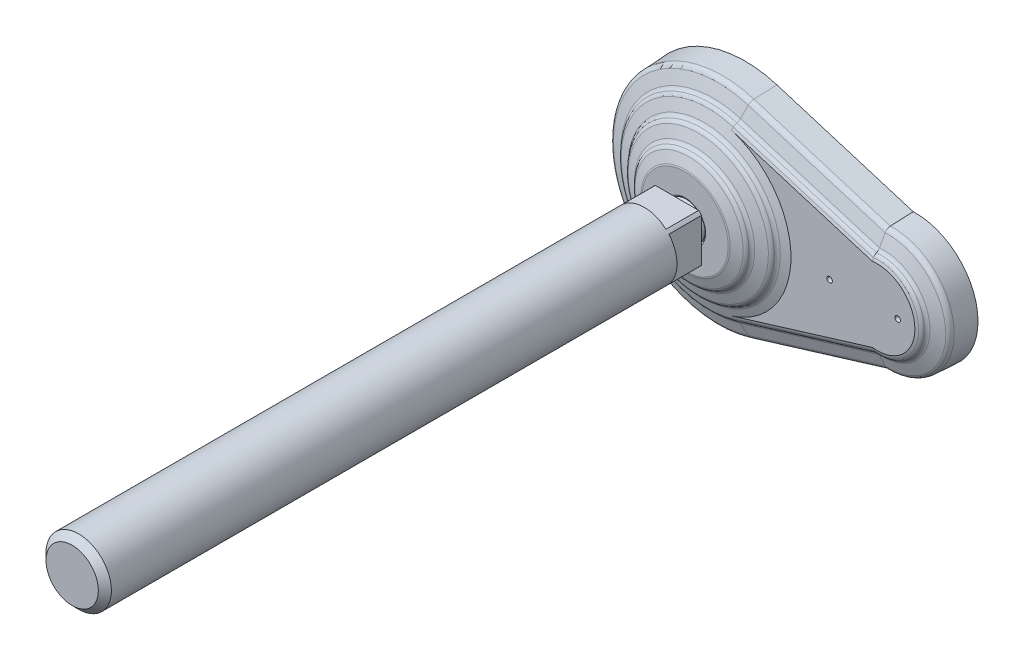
ISO-10303-21;
HEADER;
FILE_DESCRIPTION(('STEP AP214'),'2;1');
FILE_NAME('part.step','',(''),(''),'','','');
FILE_SCHEMA(('AUTOMOTIVE_DESIGN { 1 0 10303 214 1 1 1 1 }'));
ENDSEC;
DATA;
#1=APPLICATION_CONTEXT('core data for automotive mechanical design processes');
#2=APPLICATION_PROTOCOL_DEFINITION('international standard','automotive_design',2000,#1);
#3=PRODUCT_CONTEXT('',#1,'mechanical');
#4=PRODUCT('Part','Part','',(#3));
#5=PRODUCT_RELATED_PRODUCT_CATEGORY('part','',(#4));
#6=PRODUCT_DEFINITION_FORMATION('','',#4);
#7=PRODUCT_DEFINITION_CONTEXT('part definition',#1,'design');
#8=PRODUCT_DEFINITION('design','',#6,#7);
#9=PRODUCT_DEFINITION_SHAPE('','',#8);
#10=(LENGTH_UNIT() NAMED_UNIT(*) SI_UNIT(.MILLI.,.METRE.));
#11=(NAMED_UNIT(*) PLANE_ANGLE_UNIT() SI_UNIT($,.RADIAN.));
#12=(NAMED_UNIT(*) SI_UNIT($,.STERADIAN.) SOLID_ANGLE_UNIT());
#13=UNCERTAINTY_MEASURE_WITH_UNIT(LENGTH_MEASURE(1.E-05),#10,'distance_accuracy_value','');
#14=(GEOMETRIC_REPRESENTATION_CONTEXT(3) GLOBAL_UNCERTAINTY_ASSIGNED_CONTEXT((#13)) GLOBAL_UNIT_ASSIGNED_CONTEXT((#10,
#11,#12)) REPRESENTATION_CONTEXT('',''));
#15=CARTESIAN_POINT('',(0.,0.,0.));
#16=DIRECTION('',(0.,0.,1.));
#17=DIRECTION('',(1.,0.,0.));
#18=AXIS2_PLACEMENT_3D('',#15,#16,#17);
#19=CARTESIAN_POINT('',(0.,0.,39.));
#20=DIRECTION('',(0.,0.,1.));
#21=DIRECTION('',(-1.,0.,0.));
#22=AXIS2_PLACEMENT_3D('',#19,#20,#21);
#23=CYLINDRICAL_SURFACE('',#22,12.);
#24=CARTESIAN_POINT('',(0.,0.,246.6));
#25=DIRECTION('',(0.,0.,1.));
#26=DIRECTION('',(-1.,0.,0.));
#27=AXIS2_PLACEMENT_3D('',#24,#25,#26);
#28=CIRCLE('',#27,12.);
#29=CARTESIAN_POINT('',(-12.,0.,246.6));
#30=VERTEX_POINT('',#29);
#31=EDGE_CURVE('E9',#30,#30,#28,.F.);
#32=ORIENTED_EDGE('',*,*,#31,.T.);
#33=EDGE_LOOP('',(#32));
#34=FACE_BOUND('',#33,.T.);
#35=DIRECTION('',(0.,0.,1.));
#36=VECTOR('',#35,1.);
#37=CARTESIAN_POINT('',(-7.93725393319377,-9.,39.));
#38=LINE('',#37,#36);
#39=CARTESIAN_POINT('',(-7.93725393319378,-9.,39.));
#40=VERTEX_POINT('',#39);
#41=CARTESIAN_POINT('',(-7.93725393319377,-9.,27.));
#42=VERTEX_POINT('',#41);
#43=EDGE_CURVE('E159',#40,#42,#38,.F.);
#44=ORIENTED_EDGE('',*,*,#43,.F.);
#45=CARTESIAN_POINT('',(0.,0.,39.));
#46=DIRECTION('',(0.,0.,1.));
#47=DIRECTION('',(0.,-1.,0.));
#48=AXIS2_PLACEMENT_3D('',#45,#46,#47);
#49=CIRCLE('',#48,12.);
#50=CARTESIAN_POINT('',(7.93725393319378,-9.,39.));
#51=VERTEX_POINT('',#50);
#52=EDGE_CURVE('E805',#40,#51,#49,.T.);
#53=ORIENTED_EDGE('',*,*,#52,.T.);
#54=DIRECTION('',(0.,0.,1.));
#55=VECTOR('',#54,1.);
#56=CARTESIAN_POINT('',(7.93725393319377,-9.,39.));
#57=LINE('',#56,#55);
#58=CARTESIAN_POINT('',(7.93725393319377,-9.,27.));
#59=VERTEX_POINT('',#58);
#60=EDGE_CURVE('E224',#59,#51,#57,.T.);
#61=ORIENTED_EDGE('',*,*,#60,.F.);
#62=CARTESIAN_POINT('',(0.,0.,27.));
#63=DIRECTION('',(0.,0.,1.));
#64=DIRECTION('',(-1.,0.,0.));
#65=AXIS2_PLACEMENT_3D('',#62,#63,#64);
#66=CIRCLE('',#65,12.);
#67=CARTESIAN_POINT('',(9.,-7.93725393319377,27.));
#68=VERTEX_POINT('',#67);
#69=EDGE_CURVE('E207',#59,#68,#66,.T.);
#70=ORIENTED_EDGE('',*,*,#69,.T.);
#71=DIRECTION('',(0.,0.,1.));
#72=VECTOR('',#71,1.);
#73=CARTESIAN_POINT('',(9.,-7.93725393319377,39.));
#74=LINE('',#73,#72);
#75=CARTESIAN_POINT('',(9.,-7.93725393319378,39.));
#76=VERTEX_POINT('',#75);
#77=EDGE_CURVE('E221',#76,#68,#74,.F.);
#78=ORIENTED_EDGE('',*,*,#77,.F.);
#79=CARTESIAN_POINT('',(9.,7.93725393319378,39.));
#80=VERTEX_POINT('',#79);
#81=EDGE_CURVE('E301',#76,#80,#49,.T.);
#82=ORIENTED_EDGE('',*,*,#81,.T.);
#83=DIRECTION('',(0.,0.,1.));
#84=VECTOR('',#83,1.);
#85=CARTESIAN_POINT('',(9.,7.93725393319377,39.));
#86=LINE('',#85,#84);
#87=CARTESIAN_POINT('',(9.,7.93725393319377,27.));
#88=VERTEX_POINT('',#87);
#89=EDGE_CURVE('E266',#88,#80,#86,.T.);
#90=ORIENTED_EDGE('',*,*,#89,.F.);
#91=CARTESIAN_POINT('',(7.93725393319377,9.,27.));
#92=VERTEX_POINT('',#91);
#93=EDGE_CURVE('E203',#88,#92,#66,.T.);
#94=ORIENTED_EDGE('',*,*,#93,.T.);
#95=DIRECTION('',(0.,0.,1.));
#96=VECTOR('',#95,1.);
#97=CARTESIAN_POINT('',(7.93725393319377,9.,39.));
#98=LINE('',#97,#96);
#99=CARTESIAN_POINT('',(7.93725393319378,9.,39.));
#100=VERTEX_POINT('',#99);
#101=EDGE_CURVE('E184',#100,#92,#98,.F.);
#102=ORIENTED_EDGE('',*,*,#101,.F.);
#103=CARTESIAN_POINT('',(-7.93725393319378,9.,39.));
#104=VERTEX_POINT('',#103);
#105=EDGE_CURVE('E197',#100,#104,#49,.T.);
#106=ORIENTED_EDGE('',*,*,#105,.T.);
#107=DIRECTION('',(0.,0.,1.));
#108=VECTOR('',#107,1.);
#109=CARTESIAN_POINT('',(-7.93725393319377,9.,39.));
#110=LINE('',#109,#108);
#111=CARTESIAN_POINT('',(-7.93725393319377,9.,27.));
#112=VERTEX_POINT('',#111);
#113=EDGE_CURVE('E182',#112,#104,#110,.T.);
#114=ORIENTED_EDGE('',*,*,#113,.F.);
#115=CARTESIAN_POINT('',(-9.,7.93725393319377,27.));
#116=VERTEX_POINT('',#115);
#117=EDGE_CURVE('E195',#112,#116,#66,.T.);
#118=ORIENTED_EDGE('',*,*,#117,.T.);
#119=DIRECTION('',(0.,0.,1.));
#120=VECTOR('',#119,1.);
#121=CARTESIAN_POINT('',(-9.,7.93725393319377,39.));
#122=LINE('',#121,#120);
#123=CARTESIAN_POINT('',(-9.,7.93725393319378,39.));
#124=VERTEX_POINT('',#123);
#125=EDGE_CURVE('E198',#124,#116,#122,.F.);
#126=ORIENTED_EDGE('',*,*,#125,.F.);
#127=CARTESIAN_POINT('',(-9.,-7.93725393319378,39.));
#128=VERTEX_POINT('',#127);
#129=EDGE_CURVE('E806',#124,#128,#49,.T.);
#130=ORIENTED_EDGE('',*,*,#129,.T.);
#131=DIRECTION('',(0.,0.,1.));
#132=VECTOR('',#131,1.);
#133=CARTESIAN_POINT('',(-9.,-7.93725393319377,39.));
#134=LINE('',#133,#132);
#135=CARTESIAN_POINT('',(-9.,-7.93725393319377,27.));
#136=VERTEX_POINT('',#135);
#137=EDGE_CURVE('E204',#136,#128,#134,.T.);
#138=ORIENTED_EDGE('',*,*,#137,.F.);
#139=EDGE_CURVE('E206',#136,#42,#66,.T.);
#140=ORIENTED_EDGE('',*,*,#139,.T.);
#141=EDGE_LOOP('',(#44,#53,#61,#70,#78,#82,#90,#94,#102,#106,#114,#118,#126,#130,#138,#140));
#142=FACE_BOUND('',#141,.T.);
#143=ADVANCED_FACE('F15',(#34,#142),#23,.T.);
#144=CARTESIAN_POINT('',(-5.26544933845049,0.,27.));
#145=DIRECTION('',(0.,0.,1.));
#146=DIRECTION('',(-1.,0.,0.));
#147=AXIS2_PLACEMENT_3D('',#144,#145,#146);
#148=PLANE('',#147);
#149=DIRECTION('',(0.,-1.,0.));
#150=VECTOR('',#149,1.);
#151=CARTESIAN_POINT('',(-9.,9.,27.));
#152=LINE('',#151,#150);
#153=EDGE_CURVE('E32',#116,#136,#152,.T.);
#154=ORIENTED_EDGE('',*,*,#153,.F.);
#155=ORIENTED_EDGE('',*,*,#117,.F.);
#156=DIRECTION('',(-1.,0.,0.));
#157=VECTOR('',#156,1.);
#158=CARTESIAN_POINT('',(9.,9.,27.));
#159=LINE('',#158,#157);
#160=EDGE_CURVE('E177',#92,#112,#159,.T.);
#161=ORIENTED_EDGE('',*,*,#160,.F.);
#162=ORIENTED_EDGE('',*,*,#93,.F.);
#163=DIRECTION('',(0.,1.,0.));
#164=VECTOR('',#163,1.);
#165=CARTESIAN_POINT('',(9.,-9.,27.));
#166=LINE('',#165,#164);
#167=EDGE_CURVE('E189',#68,#88,#166,.T.);
#168=ORIENTED_EDGE('',*,*,#167,.F.);
#169=ORIENTED_EDGE('',*,*,#69,.F.);
#170=DIRECTION('',(1.,0.,0.));
#171=VECTOR('',#170,1.);
#172=CARTESIAN_POINT('',(-9.,-9.,27.));
#173=LINE('',#172,#171);
#174=EDGE_CURVE('E226',#42,#59,#173,.T.);
#175=ORIENTED_EDGE('',*,*,#174,.F.);
#176=ORIENTED_EDGE('',*,*,#139,.F.);
#177=EDGE_LOOP('',(#154,#155,#161,#162,#168,#169,#175,#176));
#178=FACE_BOUND('',#177,.T.);
#179=CARTESIAN_POINT('',(0.,0.,27.));
#180=DIRECTION('',(0.,0.,1.));
#181=DIRECTION('',(-1.,0.,0.));
#182=AXIS2_PLACEMENT_3D('',#179,#180,#181);
#183=CIRCLE('',#182,5.26544933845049);
#184=CARTESIAN_POINT('',(-5.26544933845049,0.,27.));
#185=VERTEX_POINT('',#184);
#186=EDGE_CURVE('E212',#185,#185,#183,.T.);
#187=ORIENTED_EDGE('',*,*,#186,.T.);
#188=EDGE_LOOP('',(#187));
#189=FACE_BOUND('',#188,.T.);
#190=ADVANCED_FACE('F200',(#178,#189),#148,.F.);
#191=CARTESIAN_POINT('',(0.,0.,20.6509999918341));
#192=DIRECTION('',(0.,0.,1.));
#193=DIRECTION('',(-1.,0.,0.));
#194=AXIS2_PLACEMENT_3D('',#191,#192,#193);
#195=DEGENERATE_TOROIDAL_SURFACE('',#194,0.000333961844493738,6.829,.T.);
#196=CARTESIAN_POINT('',(0.,0.,21.794));
#197=DIRECTION('',(0.,0.,-1.));
#198=DIRECTION('',(1.,0.,0.));
#199=AXIS2_PLACEMENT_3D('',#196,#197,#198);
#200=CIRCLE('',#199,6.733);
#201=CARTESIAN_POINT('',(6.733,0.,21.794));
#202=VERTEX_POINT('',#201);
#203=EDGE_CURVE('E273',#202,#202,#200,.T.);
#204=ORIENTED_EDGE('',*,*,#203,.F.);
#205=EDGE_LOOP('',(#204));
#206=FACE_BOUND('',#205,.T.);
#207=CARTESIAN_POINT('',(0.,0.,25.));
#208=DIRECTION('',(0.,0.,1.));
#209=DIRECTION('',(-1.,0.,0.));
#210=AXIS2_PLACEMENT_3D('',#207,#208,#209);
#211=CIRCLE('',#210,5.2654493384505);
#212=CARTESIAN_POINT('',(-5.2654493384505,0.,25.));
#213=VERTEX_POINT('',#212);
#214=EDGE_CURVE('E214',#213,#213,#211,.T.);
#215=ORIENTED_EDGE('',*,*,#214,.F.);
#216=EDGE_LOOP('',(#215));
#217=FACE_BOUND('',#216,.T.);
#218=ADVANCED_FACE('F512',(#206,#217),#195,.T.);
#219=CARTESIAN_POINT('',(0.,0.,39.));
#220=DIRECTION('',(0.,0.,1.));
#221=DIRECTION('',(-1.,0.,0.));
#222=AXIS2_PLACEMENT_3D('',#219,#220,#221);
#223=CYLINDRICAL_SURFACE('',#222,5.2654493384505);
#224=ORIENTED_EDGE('',*,*,#186,.F.);
#225=EDGE_LOOP('',(#224));
#226=FACE_BOUND('',#225,.T.);
#227=ORIENTED_EDGE('',*,*,#214,.T.);
#228=EDGE_LOOP('',(#227));
#229=FACE_BOUND('',#228,.T.);
#230=ADVANCED_FACE('F780',(#226,#229),#223,.T.);
#231=CARTESIAN_POINT('',(-9.,-9.,27.));
#232=DIRECTION('',(0.,-1.,0.));
#233=DIRECTION('',(1.,0.,0.));
#234=AXIS2_PLACEMENT_3D('',#231,#232,#233);
#235=PLANE('',#234);
#236=ORIENTED_EDGE('',*,*,#60,.T.);
#237=DIRECTION('',(-1.,0.,0.));
#238=VECTOR('',#237,1.);
#239=CARTESIAN_POINT('',(-12.,-9.,39.));
#240=LINE('',#239,#238);
#241=EDGE_CURVE('E238',#51,#40,#240,.T.);
#242=ORIENTED_EDGE('',*,*,#241,.T.);
#243=ORIENTED_EDGE('',*,*,#43,.T.);
#244=ORIENTED_EDGE('',*,*,#174,.T.);
#245=EDGE_LOOP('',(#236,#242,#243,#244));
#246=FACE_BOUND('',#245,.T.);
#247=ADVANCED_FACE('F778',(#246),#235,.T.);
#248=CARTESIAN_POINT('',(9.,-9.,27.));
#249=DIRECTION('',(1.,0.,0.));
#250=DIRECTION('',(0.,1.,0.));
#251=AXIS2_PLACEMENT_3D('',#248,#249,#250);
#252=PLANE('',#251);
#253=ORIENTED_EDGE('',*,*,#89,.T.);
#254=DIRECTION('',(0.,-1.,0.));
#255=VECTOR('',#254,1.);
#256=CARTESIAN_POINT('',(9.,0.,39.));
#257=LINE('',#256,#255);
#258=EDGE_CURVE('E245',#80,#76,#257,.T.);
#259=ORIENTED_EDGE('',*,*,#258,.T.);
#260=ORIENTED_EDGE('',*,*,#77,.T.);
#261=ORIENTED_EDGE('',*,*,#167,.T.);
#262=EDGE_LOOP('',(#253,#259,#260,#261));
#263=FACE_BOUND('',#262,.T.);
#264=ADVANCED_FACE('F774',(#263),#252,.T.);
#265=CARTESIAN_POINT('',(9.,9.,27.));
#266=DIRECTION('',(0.,1.,0.));
#267=DIRECTION('',(-1.,0.,0.));
#268=AXIS2_PLACEMENT_3D('',#265,#266,#267);
#269=PLANE('',#268);
#270=ORIENTED_EDGE('',*,*,#113,.T.);
#271=DIRECTION('',(1.,0.,0.));
#272=VECTOR('',#271,1.);
#273=CARTESIAN_POINT('',(-12.,9.,39.));
#274=LINE('',#273,#272);
#275=EDGE_CURVE('E249',#104,#100,#274,.T.);
#276=ORIENTED_EDGE('',*,*,#275,.T.);
#277=ORIENTED_EDGE('',*,*,#101,.T.);
#278=ORIENTED_EDGE('',*,*,#160,.T.);
#279=EDGE_LOOP('',(#270,#276,#277,#278));
#280=FACE_BOUND('',#279,.T.);
#281=ADVANCED_FACE('F179',(#280),#269,.T.);
#282=CARTESIAN_POINT('',(-9.,9.,27.));
#283=DIRECTION('',(-1.,0.,0.));
#284=DIRECTION('',(0.,-1.,0.));
#285=AXIS2_PLACEMENT_3D('',#282,#283,#284);
#286=PLANE('',#285);
#287=ORIENTED_EDGE('',*,*,#137,.T.);
#288=DIRECTION('',(0.,1.,0.));
#289=VECTOR('',#288,1.);
#290=CARTESIAN_POINT('',(-9.,0.,39.));
#291=LINE('',#290,#289);
#292=EDGE_CURVE('E262',#128,#124,#291,.T.);
#293=ORIENTED_EDGE('',*,*,#292,.T.);
#294=ORIENTED_EDGE('',*,*,#125,.T.);
#295=ORIENTED_EDGE('',*,*,#153,.T.);
#296=EDGE_LOOP('',(#287,#293,#294,#295));
#297=FACE_BOUND('',#296,.T.);
#298=ADVANCED_FACE('F754',(#297),#286,.T.);
#299=CARTESIAN_POINT('',(0.,0.,0.));
#300=DIRECTION('',(0.,0.,1.));
#301=DIRECTION('',(0.,-1.,0.));
#302=AXIS2_PLACEMENT_3D('',#299,#300,#301);
#303=PLANE('',#302);
#304=DIRECTION('',(-0.951485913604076,0.307692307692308,0.));
#305=VECTOR('',#304,1.);
#306=CARTESIAN_POINT('',(69.9230769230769,15.2237746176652,0.));
#307=LINE('',#306,#305);
#308=CARTESIAN_POINT('',(69.9230769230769,15.2237746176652,0.));
#309=VERTEX_POINT('',#308);
#310=CARTESIAN_POINT('',(11.0769230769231,34.2534928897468,0.));
#311=VERTEX_POINT('',#310);
#312=EDGE_CURVE('E285',#309,#311,#307,.T.);
#313=ORIENTED_EDGE('',*,*,#312,.F.);
#314=CARTESIAN_POINT('',(65.,0.,0.));
#315=DIRECTION('',(0.,0.,1.));
#316=DIRECTION('',(1.,0.,0.));
#317=AXIS2_PLACEMENT_3D('',#314,#315,#316);
#318=CIRCLE('',#317,16.);
#319=CARTESIAN_POINT('',(69.9230769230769,-15.2237746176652,0.));
#320=VERTEX_POINT('',#319);
#321=EDGE_CURVE('E295',#320,#309,#318,.T.);
#322=ORIENTED_EDGE('',*,*,#321,.F.);
#323=DIRECTION('',(0.951485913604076,0.307692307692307,0.));
#324=VECTOR('',#323,1.);
#325=CARTESIAN_POINT('',(11.0769230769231,-34.2534928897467,0.));
#326=LINE('',#325,#324);
#327=CARTESIAN_POINT('',(11.0769230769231,-34.2534928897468,0.));
#328=VERTEX_POINT('',#327);
#329=EDGE_CURVE('E292',#328,#320,#326,.T.);
#330=ORIENTED_EDGE('',*,*,#329,.F.);
#331=CARTESIAN_POINT('',(0.,0.,0.));
#332=DIRECTION('',(0.,0.,1.));
#333=DIRECTION('',(1.,0.,0.));
#334=AXIS2_PLACEMENT_3D('',#331,#332,#333);
#335=CIRCLE('',#334,36.);
#336=EDGE_CURVE('E288',#311,#328,#335,.T.);
#337=ORIENTED_EDGE('',*,*,#336,.F.);
#338=EDGE_LOOP('',(#313,#322,#330,#337));
#339=FACE_BOUND('',#338,.T.);
#340=ADVANCED_FACE('F514',(#339),#303,.F.);
#341=CARTESIAN_POINT('',(11.0769230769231,-34.2534928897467,0.));
#342=DIRECTION('',(0.307692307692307,-0.951485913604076,0.));
#343=DIRECTION('',(0.951485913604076,0.307692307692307,0.));
#344=AXIS2_PLACEMENT_3D('',#341,#342,#343);
#345=PLANE('',#344);
#346=DIRECTION('',(0.951485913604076,0.307692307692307,0.));
#347=VECTOR('',#346,1.);
#348=CARTESIAN_POINT('',(11.0769230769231,-34.2534928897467,2.));
#349=LINE('',#348,#347);
#350=CARTESIAN_POINT('',(11.0769230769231,-34.2534928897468,2.));
#351=VERTEX_POINT('',#350);
#352=CARTESIAN_POINT('',(69.9230769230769,-15.2237746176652,2.));
#353=VERTEX_POINT('',#352);
#354=EDGE_CURVE('E304',#351,#353,#349,.T.);
#355=ORIENTED_EDGE('',*,*,#354,.F.);
#356=DIRECTION('',(0.,0.,1.));
#357=VECTOR('',#356,1.);
#358=CARTESIAN_POINT('',(11.0769230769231,-34.2534928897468,0.));
#359=LINE('',#358,#357);
#360=EDGE_CURVE('E312',#328,#351,#359,.T.);
#361=ORIENTED_EDGE('',*,*,#360,.F.);
#362=ORIENTED_EDGE('',*,*,#329,.T.);
#363=DIRECTION('',(0.,0.,1.));
#364=VECTOR('',#363,1.);
#365=CARTESIAN_POINT('',(69.9230769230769,-15.2237746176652,0.));
#366=LINE('',#365,#364);
#367=EDGE_CURVE('E310',#320,#353,#366,.T.);
#368=ORIENTED_EDGE('',*,*,#367,.T.);
#369=EDGE_LOOP('',(#355,#361,#362,#368));
#370=FACE_BOUND('',#369,.T.);
#371=ADVANCED_FACE('F771',(#370),#345,.T.);
#372=CARTESIAN_POINT('',(0.,0.,0.));
#373=DIRECTION('',(0.,0.,1.));
#374=DIRECTION('',(0.,-1.,0.));
#375=AXIS2_PLACEMENT_3D('',#372,#373,#374);
#376=CYLINDRICAL_SURFACE('',#375,36.);
#377=CARTESIAN_POINT('',(0.,0.,2.));
#378=DIRECTION('',(0.,0.,1.));
#379=DIRECTION('',(1.,0.,0.));
#380=AXIS2_PLACEMENT_3D('',#377,#378,#379);
#381=CIRCLE('',#380,36.);
#382=CARTESIAN_POINT('',(11.0769230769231,34.2534928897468,2.));
#383=VERTEX_POINT('',#382);
#384=EDGE_CURVE('E300',#383,#351,#381,.T.);
#385=ORIENTED_EDGE('',*,*,#384,.F.);
#386=DIRECTION('',(0.,0.,1.));
#387=VECTOR('',#386,1.);
#388=CARTESIAN_POINT('',(11.0769230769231,34.2534928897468,0.));
#389=LINE('',#388,#387);
#390=EDGE_CURVE('E314',#311,#383,#389,.T.);
#391=ORIENTED_EDGE('',*,*,#390,.F.);
#392=ORIENTED_EDGE('',*,*,#336,.T.);
#393=ORIENTED_EDGE('',*,*,#360,.T.);
#394=EDGE_LOOP('',(#385,#391,#392,#393));
#395=FACE_BOUND('',#394,.T.);
#396=ADVANCED_FACE('F1138',(#395),#376,.T.);
#397=CARTESIAN_POINT('',(69.9230769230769,15.2237746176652,0.));
#398=DIRECTION('',(0.307692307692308,0.951485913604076,0.));
#399=DIRECTION('',(-0.951485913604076,0.307692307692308,0.));
#400=AXIS2_PLACEMENT_3D('',#397,#398,#399);
#401=PLANE('',#400);
#402=DIRECTION('',(-0.951485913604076,0.307692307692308,0.));
#403=VECTOR('',#402,1.);
#404=CARTESIAN_POINT('',(69.9230769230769,15.2237746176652,2.));
#405=LINE('',#404,#403);
#406=CARTESIAN_POINT('',(69.9230769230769,15.2237746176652,2.));
#407=VERTEX_POINT('',#406);
#408=EDGE_CURVE('E150',#407,#383,#405,.T.);
#409=ORIENTED_EDGE('',*,*,#408,.F.);
#410=DIRECTION('',(0.,0.,1.));
#411=VECTOR('',#410,1.);
#412=CARTESIAN_POINT('',(69.9230769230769,15.2237746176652,0.));
#413=LINE('',#412,#411);
#414=EDGE_CURVE('E298',#309,#407,#413,.T.);
#415=ORIENTED_EDGE('',*,*,#414,.F.);
#416=ORIENTED_EDGE('',*,*,#312,.T.);
#417=ORIENTED_EDGE('',*,*,#390,.T.);
#418=EDGE_LOOP('',(#409,#415,#416,#417));
#419=FACE_BOUND('',#418,.T.);
#420=ADVANCED_FACE('F538',(#419),#401,.T.);
#421=CARTESIAN_POINT('',(65.,0.,0.));
#422=DIRECTION('',(0.,0.,1.));
#423=DIRECTION('',(0.,-1.,0.));
#424=AXIS2_PLACEMENT_3D('',#421,#422,#423);
#425=CYLINDRICAL_SURFACE('',#424,16.);
#426=CARTESIAN_POINT('',(65.,0.,2.));
#427=DIRECTION('',(0.,0.,1.));
#428=DIRECTION('',(1.,0.,0.));
#429=AXIS2_PLACEMENT_3D('',#426,#427,#428);
#430=CIRCLE('',#429,16.);
#431=EDGE_CURVE('E289',#353,#407,#430,.T.);
#432=ORIENTED_EDGE('',*,*,#431,.F.);
#433=ORIENTED_EDGE('',*,*,#367,.F.);
#434=ORIENTED_EDGE('',*,*,#321,.T.);
#435=ORIENTED_EDGE('',*,*,#414,.T.);
#436=EDGE_LOOP('',(#432,#433,#434,#435));
#437=FACE_BOUND('',#436,.T.);
#438=ADVANCED_FACE('F523',(#437),#425,.T.);
#439=CARTESIAN_POINT('',(62.5,0.,2.));
#440=DIRECTION('',(0.,0.,-1.));
#441=DIRECTION('',(0.,1.,0.));
#442=AXIS2_PLACEMENT_3D('',#439,#440,#441);
#443=CONICAL_SURFACE('',#442,22.9787234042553,0.0523365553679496);
#444=CARTESIAN_POINT('',(62.5,0.,10.3041173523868));
#445=DIRECTION('',(0.,0.,1.));
#446=DIRECTION('',(0.,-1.,0.));
#447=AXIS2_PLACEMENT_3D('',#444,#445,#446);
#448=CIRCLE('',#447,22.5437172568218);
#449=CARTESIAN_POINT('',(61.6407011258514,-22.5273343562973,10.3041173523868));
#450=VERTEX_POINT('',#449);
#451=CARTESIAN_POINT('',(61.6407011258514,22.5273343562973,10.3041173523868));
#452=VERTEX_POINT('',#451);
#453=EDGE_CURVE('E344',#450,#452,#448,.T.);
#454=ORIENTED_EDGE('',*,*,#453,.F.);
#455=CARTESIAN_POINT('',(61.6406997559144,-22.5273238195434,10.3043173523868));
#456=CARTESIAN_POINT('',(61.6501805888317,-22.600242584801,8.92023165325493));
#457=CARTESIAN_POINT('',(61.6596900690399,-22.6731526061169,7.53614569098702));
#458=CARTESIAN_POINT('',(61.6787663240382,-22.8189551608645,4.76797324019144));
#459=CARTESIAN_POINT('',(61.6883330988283,-22.8918476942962,3.38388675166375));
#460=CARTESIAN_POINT('',(61.6979285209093,-22.9647314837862,1.9998));
#461=B_SPLINE_CURVE_WITH_KNOTS('',3,(#455,#456,#457,#458,#459,#460),.UNSPECIFIED.,.F.,.F.,(4,2,
4),(0.,4.15811282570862,8.31622565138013),.UNSPECIFIED.);
#462=CARTESIAN_POINT('',(61.697927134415,-22.9647209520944,2.));
#463=VERTEX_POINT('',#462);
#464=EDGE_CURVE('E651',#450,#463,#461,.T.);
#465=ORIENTED_EDGE('',*,*,#464,.T.);
#466=CARTESIAN_POINT('',(62.5,0.,2.));
#467=DIRECTION('',(0.,0.,1.));
#468=DIRECTION('',(0.,-1.,0.));
#469=AXIS2_PLACEMENT_3D('',#466,#467,#468);
#470=CIRCLE('',#469,22.9787234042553);
#471=CARTESIAN_POINT('',(61.6979271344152,22.9647209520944,2.));
#472=VERTEX_POINT('',#471);
#473=EDGE_CURVE('E346',#463,#472,#470,.T.);
#474=ORIENTED_EDGE('',*,*,#473,.T.);
#475=CARTESIAN_POINT('',(61.6979285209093,22.9647314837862,1.9998));
#476=CARTESIAN_POINT('',(61.6883330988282,22.8918476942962,3.38388675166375));
#477=CARTESIAN_POINT('',(61.6787663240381,22.8189551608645,4.76797324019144));
#478=CARTESIAN_POINT('',(61.6596900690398,22.6731526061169,7.53614569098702));
#479=CARTESIAN_POINT('',(61.6501805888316,22.600242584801,8.92023165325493));
#480=CARTESIAN_POINT('',(61.6406997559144,22.5273238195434,10.3043173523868));
#481=B_SPLINE_CURVE_WITH_KNOTS('',3,(#475,#476,#477,#478,#479,#480),.UNSPECIFIED.,.F.,.F.,(4,2,
4),(0.,4.15811282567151,8.31622565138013),.UNSPECIFIED.);
#482=EDGE_CURVE('E697',#472,#452,#481,.T.);
#483=ORIENTED_EDGE('',*,*,#482,.T.);
#484=EDGE_LOOP('',(#454,#465,#474,#483));
#485=FACE_BOUND('',#484,.T.);
#486=ADVANCED_FACE('F517',(#485),#443,.T.);
#487=CARTESIAN_POINT('',(64.1644462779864,-21.755748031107,10.3041173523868));
#488=DIRECTION('',(-0.291971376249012,0.9549953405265,-0.0523126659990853));
#489=DIRECTION('',(-0.956304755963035,-0.292371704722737,0.));
#490=AXIS2_PLACEMENT_3D('',#487,#488,#489);
#491=PLANE('',#490);
#492=ORIENTED_EDGE('',*,*,#464,.F.);
#493=DIRECTION('',(-0.956304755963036,-0.292371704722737,0.));
#494=VECTOR('',#493,1.);
#495=CARTESIAN_POINT('',(64.1644462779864,-21.755748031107,10.3041173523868));
#496=LINE('',#495,#494);
#497=CARTESIAN_POINT('',(11.5676847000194,-37.8361917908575,10.3041173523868));
#498=VERTEX_POINT('',#497);
#499=EDGE_CURVE('E600',#450,#498,#496,.T.);
#500=ORIENTED_EDGE('',*,*,#499,.T.);
#501=DIRECTION('',(-0.0152947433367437,0.050026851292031,0.998630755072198));
#502=VECTOR('',#501,1.);
#503=CARTESIAN_POINT('',(11.6948681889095,-38.2521902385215,2.));
#504=LINE('',#503,#502);
#505=CARTESIAN_POINT('',(11.6948681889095,-38.2521902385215,2.));
#506=VERTEX_POINT('',#505);
#507=EDGE_CURVE('E606',#506,#498,#504,.T.);
#508=ORIENTED_EDGE('',*,*,#507,.F.);
#509=DIRECTION('',(-0.956304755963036,-0.292371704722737,0.));
#510=VECTOR('',#509,1.);
#511=CARTESIAN_POINT('',(64.2916297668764,-22.1717464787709,2.));
#512=LINE('',#511,#510);
#513=EDGE_CURVE('E144',#463,#506,#512,.T.);
#514=ORIENTED_EDGE('',*,*,#513,.F.);
#515=EDGE_LOOP('',(#492,#500,#508,#514));
#516=FACE_BOUND('',#515,.T.);
#517=ADVANCED_FACE('F508',(#516),#491,.F.);
#518=CARTESIAN_POINT('',(0.,0.,2.));
#519=DIRECTION('',(0.,0.,1.));
#520=DIRECTION('',(-1.,0.,0.));
#521=AXIS2_PLACEMENT_3D('',#518,#519,#520);
#522=PLANE('',#521);
#523=DIRECTION('',(-0.956304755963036,0.292371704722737,0.));
#524=VECTOR('',#523,1.);
#525=CARTESIAN_POINT('',(64.2916297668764,22.1717464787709,2.));
#526=LINE('',#525,#524);
#527=CARTESIAN_POINT('',(11.6948681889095,38.2521902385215,2.));
#528=VERTEX_POINT('',#527);
#529=EDGE_CURVE('E653',#472,#528,#526,.T.);
#530=ORIENTED_EDGE('',*,*,#529,.F.);
#531=ORIENTED_EDGE('',*,*,#473,.F.);
#532=ORIENTED_EDGE('',*,*,#513,.T.);
#533=CARTESIAN_POINT('',(0.,0.,2.));
#534=DIRECTION('',(0.,0.,1.));
#535=DIRECTION('',(-1.,0.,0.));
#536=AXIS2_PLACEMENT_3D('',#533,#534,#535);
#537=CIRCLE('',#536,40.);
#538=EDGE_CURVE('E389',#528,#506,#537,.T.);
#539=ORIENTED_EDGE('',*,*,#538,.F.);
#540=EDGE_LOOP('',(#530,#531,#532,#539));
#541=FACE_BOUND('',#540,.T.);
#542=ORIENTED_EDGE('',*,*,#431,.T.);
#543=ORIENTED_EDGE('',*,*,#408,.T.);
#544=ORIENTED_EDGE('',*,*,#384,.T.);
#545=ORIENTED_EDGE('',*,*,#354,.T.);
#546=EDGE_LOOP('',(#542,#543,#544,#545));
#547=FACE_BOUND('',#546,.T.);
#548=ADVANCED_FACE('F398',(#541,#547),#522,.F.);
#549=CARTESIAN_POINT('',(64.2916297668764,22.1717464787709,2.));
#550=DIRECTION('',(-0.291971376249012,-0.9549953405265,-0.0523126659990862));
#551=DIRECTION('',(0.956304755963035,-0.292371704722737,0.));
#552=AXIS2_PLACEMENT_3D('',#549,#550,#551);
#553=PLANE('',#552);
#554=ORIENTED_EDGE('',*,*,#482,.F.);
#555=ORIENTED_EDGE('',*,*,#529,.T.);
#556=DIRECTION('',(-0.0152947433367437,-0.050026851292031,0.998630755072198));
#557=VECTOR('',#556,1.);
#558=CARTESIAN_POINT('',(11.6948681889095,38.2521902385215,2.));
#559=LINE('',#558,#557);
#560=CARTESIAN_POINT('',(11.5676847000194,37.8361917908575,10.3041173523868));
#561=VERTEX_POINT('',#560);
#562=EDGE_CURVE('E620',#528,#561,#559,.T.);
#563=ORIENTED_EDGE('',*,*,#562,.T.);
#564=DIRECTION('',(-0.956304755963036,0.292371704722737,0.));
#565=VECTOR('',#564,1.);
#566=CARTESIAN_POINT('',(64.1644462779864,21.755748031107,10.3041173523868));
#567=LINE('',#566,#565);
#568=EDGE_CURVE('E654',#452,#561,#567,.T.);
#569=ORIENTED_EDGE('',*,*,#568,.F.);
#570=EDGE_LOOP('',(#554,#555,#563,#569));
#571=FACE_BOUND('',#570,.T.);
#572=ADVANCED_FACE('F478',(#571),#553,.F.);
#573=CARTESIAN_POINT('',(62.5,0.,10.1991258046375));
#574=DIRECTION('',(0.,0.,1.));
#575=DIRECTION('',(0.,-1.,0.));
#576=AXIS2_PLACEMENT_3D('',#573,#574,#575);
#577=TOROIDAL_SURFACE('',#576,20.5394653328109,2.007);
#578=CARTESIAN_POINT('',(61.6407233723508,-22.5275054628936,10.0974340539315));
#579=CARTESIAN_POINT('',(61.6409510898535,-22.5292569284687,10.1317993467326));
#580=CARTESIAN_POINT('',(61.6410635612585,-22.5301219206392,10.1661964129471));
#581=CARTESIAN_POINT('',(61.6410572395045,-22.5300732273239,10.235045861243));
#582=CARTESIAN_POINT('',(61.6409380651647,-22.5291566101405,10.2694982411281));
#583=CARTESIAN_POINT('',(61.6399396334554,-22.5214778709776,10.4153785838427));
#584=CARTESIAN_POINT('',(61.6379561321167,-22.5062239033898,10.526490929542));
#585=CARTESIAN_POINT('',(61.6316126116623,-22.4573679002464,10.7446232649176));
#586=CARTESIAN_POINT('',(61.6272490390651,-22.4237384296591,10.8516368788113));
#587=CARTESIAN_POINT('',(61.6163034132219,-22.339189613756,11.058357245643));
#588=CARTESIAN_POINT('',(61.6097238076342,-22.2882893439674,11.1580719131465));
#589=CARTESIAN_POINT('',(61.5945702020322,-22.1707054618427,11.3475467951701));
#590=CARTESIAN_POINT('',(61.5859960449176,-22.1040206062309,11.4373062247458));
#591=CARTESIAN_POINT('',(61.5670698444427,-21.9562760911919,11.6050783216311));
#592=CARTESIAN_POINT('',(61.5567047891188,-21.8751110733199,11.6829965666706));
#593=CARTESIAN_POINT('',(61.5345911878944,-21.7011851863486,11.8241014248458));
#594=CARTESIAN_POINT('',(61.5228449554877,-21.6084436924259,11.8873121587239));
#595=CARTESIAN_POINT('',(61.5046129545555,-21.4637836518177,11.9692866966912));
#596=CARTESIAN_POINT('',(61.4985079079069,-21.4152343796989,11.9942523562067));
#597=CARTESIAN_POINT('',(61.4860940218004,-21.3162718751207,12.0401972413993));
#598=CARTESIAN_POINT('',(61.4797850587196,-21.2658575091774,12.0611739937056));
#599=CARTESIAN_POINT('',(61.4596293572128,-21.1043762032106,12.1208327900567));
#600=CARTESIAN_POINT('',(61.4454888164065,-20.9904779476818,12.1519983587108));
#601=CARTESIAN_POINT('',(61.4169436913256,-20.7591475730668,12.1941665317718));
#602=CARTESIAN_POINT('',(61.4025394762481,-20.6417202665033,12.2051954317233));
#603=CARTESIAN_POINT('',(61.3876252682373,-20.5193667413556,12.2061070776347));
#604=CARTESIAN_POINT('',(61.3870090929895,-20.5143103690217,12.2061258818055));
#605=CARTESIAN_POINT('',(61.3863931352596,-20.5092543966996,12.2061258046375));
#606=B_SPLINE_CURVE_WITH_KNOTS('',3,(#578,#579,#580,#581,#582,#583,#584,#585,#586,#587,#588,
#589,#590,#591,#592,#593,#594,#595,#596,#597,#598,#599,#600,#601,#602,#603,#604,#605),
.UNSPECIFIED.,.F.,.F.,(4,2,2,2,2,2,2,2,2,2,2,2,2,4),(0.,0.103191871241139,0.20655369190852,
0.541275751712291,0.87649892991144,1.21135305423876,1.54623356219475,1.8836582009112,
2.22052549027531,2.38517216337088,2.54992059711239,2.9048600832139,3.25933573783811,
3.2746170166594),.UNSPECIFIED.);
#607=CARTESIAN_POINT('',(61.4734629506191,-21.2152067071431,12.0798866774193));
#608=VERTEX_POINT('',#607);
#609=EDGE_CURVE('E1245',#450,#608,#606,.T.);
#610=ORIENTED_EDGE('',*,*,#609,.F.);
#611=ORIENTED_EDGE('',*,*,#453,.T.);
#612=CARTESIAN_POINT('',(61.3863931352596,20.5092543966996,12.2061258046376));
#613=CARTESIAN_POINT('',(61.3870091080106,20.5143104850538,12.2061258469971));
#614=CARTESIAN_POINT('',(61.3876252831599,20.5193668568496,12.206107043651));
#615=CARTESIAN_POINT('',(61.3988855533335,20.6117442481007,12.2054193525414));
#616=CARTESIAN_POINT('',(61.4095840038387,20.6991031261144,12.1991511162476));
#617=CARTESIAN_POINT('',(61.4308936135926,20.8723273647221,12.1754412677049));
#618=CARTESIAN_POINT('',(61.4415047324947,20.9581920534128,12.1579947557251));
#619=CARTESIAN_POINT('',(61.4555813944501,21.0716202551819,12.1272225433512));
#620=CARTESIAN_POINT('',(61.4591730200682,21.1005182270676,12.1186877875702));
#621=CARTESIAN_POINT('',(61.4663157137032,21.1579059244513,12.1003430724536));
#622=CARTESIAN_POINT('',(61.4698667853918,21.1863956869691,12.090533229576));
#623=CARTESIAN_POINT('',(61.4866782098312,21.3210820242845,12.0407628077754));
#624=CARTESIAN_POINT('',(61.4996430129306,21.4243838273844,11.9924168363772));
#625=CARTESIAN_POINT('',(61.5245148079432,21.6216549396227,11.8789198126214));
#626=CARTESIAN_POINT('',(61.5364193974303,21.7156031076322,11.8137318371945));
#627=CARTESIAN_POINT('',(61.5587594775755,21.8912250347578,11.6683429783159));
#628=CARTESIAN_POINT('',(61.5691956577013,21.9729045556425,11.5881491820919));
#629=CARTESIAN_POINT('',(61.5882470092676,22.1215501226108,11.4149543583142));
#630=CARTESIAN_POINT('',(61.5968625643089,22.1885192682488,11.3219560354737));
#631=CARTESIAN_POINT('',(61.6119005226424,22.3051440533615,11.1267480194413));
#632=CARTESIAN_POINT('',(61.6183432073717,22.3549598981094,11.0246354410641));
#633=CARTESIAN_POINT('',(61.6289130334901,22.4365717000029,10.8134345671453));
#634=CARTESIAN_POINT('',(61.6330436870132,22.4683949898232,10.704357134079));
#635=CARTESIAN_POINT('',(61.6371976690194,22.5003783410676,10.5457196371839));
#636=CARTESIAN_POINT('',(61.6382205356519,22.5082502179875,10.4976293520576));
#637=CARTESIAN_POINT('',(61.639806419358,22.5204527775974,10.4010313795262));
#638=CARTESIAN_POINT('',(61.6403698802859,22.52478687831,10.3525241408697));
#639=CARTESIAN_POINT('',(61.6411729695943,22.5309631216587,10.2351641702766));
#640=CARTESIAN_POINT('',(61.641181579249,22.5310278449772,10.1662118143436));
#641=CARTESIAN_POINT('',(61.6407233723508,22.5275054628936,10.0974340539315));
#642=B_SPLINE_CURVE_WITH_KNOTS('',3,(#612,#613,#614,#615,#616,#617,#618,#619,#620,#621,#622,
#623,#624,#625,#626,#627,#628,#629,#630,#631,#632,#633,#634,#635,#636,#637,#638,#639,#640,#641),
.UNSPECIFIED.,.F.,.F.,(4,2,2,2,2,2,2,2,2,2,2,2,2,2,4),(0.,0.0152812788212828,0.279174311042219,
0.543183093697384,0.634194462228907,0.725197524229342,1.06775959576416,1.41107914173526,
1.75423694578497,2.09732237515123,2.43711059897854,2.77638125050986,2.92250118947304,
3.06847978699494,3.27496314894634),.UNSPECIFIED.);
#643=CARTESIAN_POINT('',(61.4734629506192,21.2152067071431,12.0798866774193));
#644=VERTEX_POINT('',#643);
#645=EDGE_CURVE('E467',#644,#452,#642,.T.);
#646=ORIENTED_EDGE('',*,*,#645,.F.);
#647=CARTESIAN_POINT('',(62.5,0.,12.0798866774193));
#648=DIRECTION('',(0.,0.,1.));
#649=DIRECTION('',(0.,-1.,0.));
#650=AXIS2_PLACEMENT_3D('',#647,#648,#649);
#651=CIRCLE('',#650,21.2400276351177);
#652=EDGE_CURVE('E342',#608,#644,#651,.T.);
#653=ORIENTED_EDGE('',*,*,#652,.F.);
#654=EDGE_LOOP('',(#610,#611,#646,#653));
#655=FACE_BOUND('',#654,.T.);
#656=ADVANCED_FACE('F449',(#655),#577,.T.);
#657=CARTESIAN_POINT('',(63.5784597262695,-19.8390723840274,10.1991258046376));
#658=DIRECTION('',(-0.956304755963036,-0.292371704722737,0.));
#659=DIRECTION('',(0.292371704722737,-0.956304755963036,0.));
#660=AXIS2_PLACEMENT_3D('',#657,#658,#659);
#661=CYLINDRICAL_SURFACE('',#660,2.00699999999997);
#662=ORIENTED_EDGE('',*,*,#499,.F.);
#663=ORIENTED_EDGE('',*,*,#609,.T.);
#664=DIRECTION('',(-0.956304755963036,-0.292371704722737,0.));
#665=VECTOR('',#664,1.);
#666=CARTESIAN_POINT('',(63.7832843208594,-20.5090234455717,12.0798866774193));
#667=LINE('',#666,#665);
#668=CARTESIAN_POINT('',(11.1865227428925,-36.5894672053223,12.0798866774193));
#669=VERTEX_POINT('',#668);
#670=EDGE_CURVE('E597',#608,#669,#667,.T.);
#671=ORIENTED_EDGE('',*,*,#670,.T.);
#672=CARTESIAN_POINT('',(10.9816981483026,-35.9195161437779,10.1991258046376));
#673=DIRECTION('',(0.956304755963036,0.292371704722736,0.));
#674=DIRECTION('',(-0.292371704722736,0.956304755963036,0.));
#675=AXIS2_PLACEMENT_3D('',#672,#673,#674);
#676=CIRCLE('',#675,2.007);
#677=EDGE_CURVE('E609',#669,#498,#676,.T.);
#678=ORIENTED_EDGE('',*,*,#677,.T.);
#679=EDGE_LOOP('',(#662,#663,#671,#678));
#680=FACE_BOUND('',#679,.T.);
#681=ADVANCED_FACE('F479',(#680),#661,.T.);
#682=CARTESIAN_POINT('',(0.,0.,2.));
#683=DIRECTION('',(0.,0.,-1.));
#684=DIRECTION('',(1.,0.,0.));
#685=AXIS2_PLACEMENT_3D('',#682,#683,#684);
#686=CONICAL_SURFACE('',#685,40.,0.0523365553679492);
#687=CARTESIAN_POINT('',(0.,0.,10.3041173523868));
#688=DIRECTION('',(0.,0.,1.));
#689=DIRECTION('',(-1.,0.,0.));
#690=AXIS2_PLACEMENT_3D('',#687,#688,#689);
#691=CIRCLE('',#690,39.5649938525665);
#692=EDGE_CURVE('E640',#561,#498,#691,.T.);
#693=ORIENTED_EDGE('',*,*,#692,.F.);
#694=ORIENTED_EDGE('',*,*,#562,.F.);
#695=ORIENTED_EDGE('',*,*,#538,.T.);
#696=ORIENTED_EDGE('',*,*,#507,.T.);
#697=EDGE_LOOP('',(#693,#694,#695,#696));
#698=FACE_BOUND('',#697,.T.);
#699=ADVANCED_FACE('F499',(#698),#686,.T.);
#700=CARTESIAN_POINT('',(63.5784597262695,19.8390723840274,10.1991258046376));
#701=DIRECTION('',(-0.956304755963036,0.292371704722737,0.));
#702=DIRECTION('',(-0.292371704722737,-0.956304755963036,0.));
#703=AXIS2_PLACEMENT_3D('',#700,#701,#702);
#704=CYLINDRICAL_SURFACE('',#703,2.00699999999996);
#705=DIRECTION('',(-0.956304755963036,0.292371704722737,0.));
#706=VECTOR('',#705,1.);
#707=CARTESIAN_POINT('',(63.7832843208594,20.5090234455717,12.0798866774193));
#708=LINE('',#707,#706);
#709=CARTESIAN_POINT('',(11.1865227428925,36.5894672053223,12.0798866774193));
#710=VERTEX_POINT('',#709);
#711=EDGE_CURVE('E586',#644,#710,#708,.T.);
#712=ORIENTED_EDGE('',*,*,#711,.F.);
#713=ORIENTED_EDGE('',*,*,#645,.T.);
#714=ORIENTED_EDGE('',*,*,#568,.T.);
#715=CARTESIAN_POINT('',(10.9816981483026,35.9195161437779,10.1991258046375));
#716=DIRECTION('',(-0.956304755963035,0.292371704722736,0.));
#717=DIRECTION('',(-0.292371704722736,-0.956304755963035,0.));
#718=AXIS2_PLACEMENT_3D('',#715,#716,#717);
#719=CIRCLE('',#718,2.007);
#720=EDGE_CURVE('E623',#710,#561,#719,.T.);
#721=ORIENTED_EDGE('',*,*,#720,.F.);
#722=EDGE_LOOP('',(#712,#713,#714,#721));
#723=FACE_BOUND('',#722,.T.);
#724=ADVANCED_FACE('F407',(#723),#704,.T.);
#725=CARTESIAN_POINT('',(62.5,0.,12.0798866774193));
#726=DIRECTION('',(0.,0.,-1.));
#727=DIRECTION('',(0.,1.,0.));
#728=AXIS2_PLACEMENT_3D('',#725,#726,#727);
#729=CONICAL_SURFACE('',#728,21.2400276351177,1.21422909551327);
#730=CARTESIAN_POINT('',(62.5,0.,13.656251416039));
#731=DIRECTION('',(0.,0.,1.));
#732=DIRECTION('',(0.,-1.,0.));
#733=AXIS2_PLACEMENT_3D('',#730,#731,#732);
#734=CIRCLE('',#733,17.0080484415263);
#735=CARTESIAN_POINT('',(60.9818619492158,-16.9401584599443,13.656251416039));
#736=VERTEX_POINT('',#735);
#737=CARTESIAN_POINT('',(60.9818619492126,16.9401584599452,13.656251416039));
#738=VERTEX_POINT('',#737);
#739=EDGE_CURVE('E340',#736,#738,#734,.T.);
#740=ORIENTED_EDGE('',*,*,#739,.F.);
#741=CARTESIAN_POINT('',(60.9818053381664,-16.9396143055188,13.656451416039));
#742=CARTESIAN_POINT('',(61.0189355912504,-17.2964789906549,13.5252879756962));
#743=CARTESIAN_POINT('',(61.0571375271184,-17.653206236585,13.3940567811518));
#744=CARTESIAN_POINT('',(61.1355151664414,-18.3663907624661,13.1314756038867));
#745=CARTESIAN_POINT('',(61.1756908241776,-18.7228480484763,13.0001256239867));
#746=CARTESIAN_POINT('',(61.2578477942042,-19.435511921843,12.7373183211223));
#747=CARTESIAN_POINT('',(61.2998290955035,-19.7917185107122,12.6058609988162));
#748=CARTESIAN_POINT('',(61.3854616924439,-20.5039033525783,12.3428458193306));
#749=CARTESIAN_POINT('',(61.4291130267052,-20.8598816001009,12.2112879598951));
#750=CARTESIAN_POINT('',(61.4735304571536,-21.2157475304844,12.0796866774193));
#751=B_SPLINE_CURVE_WITH_KNOTS('',3,(#741,#742,#743,#744,#745,#746,#747,#748,#749,#750),
.UNSPECIFIED.,.F.,.F.,(4,2,2,2,4),(0.,1.14603990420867,2.29205327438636,3.43805966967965,
4.58409258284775),.UNSPECIFIED.);
#752=EDGE_CURVE('E459',#736,#608,#751,.T.);
#753=ORIENTED_EDGE('',*,*,#752,.T.);
#754=ORIENTED_EDGE('',*,*,#652,.T.);
#755=CARTESIAN_POINT('',(61.4735304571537,21.2157475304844,12.0796866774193));
#756=CARTESIAN_POINT('',(61.4291130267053,20.8598816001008,12.2112879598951));
#757=CARTESIAN_POINT('',(61.3854616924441,20.5039033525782,12.3428458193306));
#758=CARTESIAN_POINT('',(61.2998290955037,19.7917185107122,12.6058609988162));
#759=CARTESIAN_POINT('',(61.2578477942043,19.435511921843,12.7373183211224));
#760=CARTESIAN_POINT('',(61.1756908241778,18.7228480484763,13.0001256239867));
#761=CARTESIAN_POINT('',(61.1355151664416,18.3663907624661,13.1314756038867));
#762=CARTESIAN_POINT('',(61.0571375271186,17.653206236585,13.3940567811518));
#763=CARTESIAN_POINT('',(61.0189355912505,17.2964789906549,13.5252879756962));
#764=CARTESIAN_POINT('',(60.9818053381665,16.9396143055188,13.656451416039));
#765=B_SPLINE_CURVE_WITH_KNOTS('',3,(#755,#756,#757,#758,#759,#760,#761,#762,#763,#764),
.UNSPECIFIED.,.F.,.F.,(4,2,2,2,4),(0.,1.14603291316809,2.29203930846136,3.43805267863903,
4.58409258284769),.UNSPECIFIED.);
#766=EDGE_CURVE('E453',#644,#738,#765,.T.);
#767=ORIENTED_EDGE('',*,*,#766,.T.);
#768=EDGE_LOOP('',(#740,#753,#754,#767));
#769=FACE_BOUND('',#768,.T.);
#770=ADVANCED_FACE('F442',(#769),#729,.T.);
#771=CARTESIAN_POINT('',(62.545973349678,-16.4619616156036,13.656251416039));
#772=DIRECTION('',(-0.102055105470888,0.333807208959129,-0.937100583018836));
#773=DIRECTION('',(0.,0.942019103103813,0.335559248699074));
#774=AXIS2_PLACEMENT_3D('',#771,#772,#773);
#775=PLANE('',#774);
#776=ORIENTED_EDGE('',*,*,#752,.F.);
#777=DIRECTION('',(-0.956304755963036,-0.292371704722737,0.));
#778=VECTOR('',#777,1.);
#779=CARTESIAN_POINT('',(62.545973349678,-16.4619616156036,13.656251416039));
#780=LINE('',#779,#778);
#781=CARTESIAN_POINT('',(9.949211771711,-32.5424053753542,13.656251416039));
#782=VERTEX_POINT('',#781);
#783=EDGE_CURVE('E592',#736,#782,#780,.T.);
#784=ORIENTED_EDGE('',*,*,#783,.T.);
#785=DIRECTION('',(-0.273981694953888,0.896153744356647,0.349059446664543));
#786=VECTOR('',#785,1.);
#787=CARTESIAN_POINT('',(11.1865227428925,-36.5894672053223,12.0798866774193));
#788=LINE('',#787,#786);
#789=EDGE_CURVE('E612',#669,#782,#788,.T.);
#790=ORIENTED_EDGE('',*,*,#789,.F.);
#791=ORIENTED_EDGE('',*,*,#670,.F.);
#792=EDGE_LOOP('',(#776,#784,#790,#791));
#793=FACE_BOUND('',#792,.T.);
#794=ADVANCED_FACE('F447',(#793),#775,.F.);
#795=CARTESIAN_POINT('',(0.,0.,10.1991258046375));
#796=DIRECTION('',(0.,0.,1.));
#797=DIRECTION('',(-1.,0.,0.));
#798=AXIS2_PLACEMENT_3D('',#795,#796,#797);
#799=TOROIDAL_SURFACE('',#798,37.5607419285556,2.007);
#800=CARTESIAN_POINT('',(0.,0.,12.0798866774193));
#801=DIRECTION('',(0.,0.,1.));
#802=DIRECTION('',(-1.,0.,0.));
#803=AXIS2_PLACEMENT_3D('',#800,#801,#802);
#804=CIRCLE('',#803,38.2613042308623);
#805=EDGE_CURVE('E638',#710,#669,#804,.T.);
#806=ORIENTED_EDGE('',*,*,#805,.F.);
#807=ORIENTED_EDGE('',*,*,#720,.T.);
#808=ORIENTED_EDGE('',*,*,#692,.T.);
#809=ORIENTED_EDGE('',*,*,#677,.F.);
#810=EDGE_LOOP('',(#806,#807,#808,#809));
#811=FACE_BOUND('',#810,.T.);
#812=ADVANCED_FACE('F476',(#811),#799,.T.);
#813=CARTESIAN_POINT('',(63.7832843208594,20.5090234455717,12.0798866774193));
#814=DIRECTION('',(-0.102055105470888,-0.333807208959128,-0.937100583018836));
#815=DIRECTION('',(0.,0.942019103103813,-0.335559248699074));
#816=AXIS2_PLACEMENT_3D('',#813,#814,#815);
#817=PLANE('',#816);
#818=ORIENTED_EDGE('',*,*,#766,.F.);
#819=ORIENTED_EDGE('',*,*,#711,.T.);
#820=DIRECTION('',(-0.273981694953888,-0.896153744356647,0.349059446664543));
#821=VECTOR('',#820,1.);
#822=CARTESIAN_POINT('',(11.1865227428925,36.5894672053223,12.0798866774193));
#823=LINE('',#822,#821);
#824=CARTESIAN_POINT('',(9.949211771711,32.5424053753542,13.656251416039));
#825=VERTEX_POINT('',#824);
#826=EDGE_CURVE('E585',#710,#825,#823,.T.);
#827=ORIENTED_EDGE('',*,*,#826,.T.);
#828=DIRECTION('',(-0.956304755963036,0.292371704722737,0.));
#829=VECTOR('',#828,1.);
#830=CARTESIAN_POINT('',(62.545973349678,16.4619616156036,13.656251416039));
#831=LINE('',#830,#829);
#832=EDGE_CURVE('E577',#738,#825,#831,.T.);
#833=ORIENTED_EDGE('',*,*,#832,.F.);
#834=EDGE_LOOP('',(#818,#819,#827,#833));
#835=FACE_BOUND('',#834,.T.);
#836=ADVANCED_FACE('F413',(#835),#817,.F.);
#837=CARTESIAN_POINT('',(62.5,0.,15.5370123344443));
#838=DIRECTION('',(0.,0.,1.));
#839=DIRECTION('',(0.,-1.,0.));
#840=AXIS2_PLACEMENT_3D('',#837,#838,#839);
#841=TOROIDAL_SURFACE('',#840,17.70861062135,2.007);
#842=CARTESIAN_POINT('',(60.9819185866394,-16.9407028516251,13.656051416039));
#843=CARTESIAN_POINT('',(60.9763282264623,-16.8869710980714,13.675784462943));
#844=CARTESIAN_POINT('',(60.9708503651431,-16.8340792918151,13.697757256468));
#845=CARTESIAN_POINT('',(60.9601474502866,-16.7302929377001,13.7460604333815));
#846=CARTESIAN_POINT('',(60.9549224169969,-16.6793985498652,13.77239116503));
#847=CARTESIAN_POINT('',(60.9396574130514,-16.5300811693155,13.8578002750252));
#848=CARTESIAN_POINT('',(60.9300410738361,-16.4351542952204,13.9232476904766));
#849=CARTESIAN_POINT('',(60.9121877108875,-16.2575900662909,14.0693279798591));
#850=CARTESIAN_POINT('',(60.903952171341,-16.1749659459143,14.1499769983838));
#851=CARTESIAN_POINT('',(60.8890756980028,-16.0247595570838,14.3241094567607));
#852=CARTESIAN_POINT('',(60.8824301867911,-15.9571341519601,14.4175548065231));
#853=CARTESIAN_POINT('',(60.8754548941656,-15.8858007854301,14.5364334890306));
#854=CARTESIAN_POINT('',(60.8742920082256,-15.8738939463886,14.5571086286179));
#855=CARTESIAN_POINT('',(60.8720425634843,-15.8508368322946,14.59885583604));
#856=CARTESIAN_POINT('',(60.8709559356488,-15.839685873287,14.6199275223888));
#857=CARTESIAN_POINT('',(60.869906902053,-15.8289098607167,14.6412000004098));
#858=B_SPLINE_CURVE_WITH_KNOTS('',3,(#842,#843,#844,#845,#846,#847,#848,#849,#850,#851,#852,
#853,#854,#855,#856,#857),.UNSPECIFIED.,.F.,.F.,(4,2,2,2,2,2,2,4),(0.,0.172434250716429,
0.344882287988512,0.690191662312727,1.0358698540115,1.38054058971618,1.4521941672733,
1.52378201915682),.UNSPECIFIED.);
#859=CARTESIAN_POINT('',(60.8699167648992,-15.8290111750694,14.6410000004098));
#860=VERTEX_POINT('',#859);
#861=EDGE_CURVE('E424',#736,#860,#858,.T.);
#862=ORIENTED_EDGE('',*,*,#861,.F.);
#863=ORIENTED_EDGE('',*,*,#739,.T.);
#864=CARTESIAN_POINT('',(60.869906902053,15.8289098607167,14.6412000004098));
#865=CARTESIAN_POINT('',(60.8724049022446,15.8545692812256,14.5905409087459));
#866=CARTESIAN_POINT('',(60.8751177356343,15.882373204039,14.5410120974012));
#867=CARTESIAN_POINT('',(60.8809599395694,15.9420653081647,14.4445128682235));
#868=CARTESIAN_POINT('',(60.8840892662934,15.9739530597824,14.3975421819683));
#869=CARTESIAN_POINT('',(60.8940798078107,16.0754098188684,14.2609440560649));
#870=CARTESIAN_POINT('',(60.9015461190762,16.1507985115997,14.1755790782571));
#871=CARTESIAN_POINT('',(60.9179069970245,16.3146445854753,14.0187596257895));
#872=CARTESIAN_POINT('',(60.9268017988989,16.4031041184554,13.9473074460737));
#873=CARTESIAN_POINT('',(60.9458071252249,16.5904449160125,13.8202080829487));
#874=CARTESIAN_POINT('',(60.9559150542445,16.6893038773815,13.7645279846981));
#875=CARTESIAN_POINT('',(60.9690169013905,16.8162843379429,13.7062217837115));
#876=CARTESIAN_POINT('',(60.9715630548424,16.8409104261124,13.6954970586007));
#877=CARTESIAN_POINT('',(60.9767040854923,16.8905299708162,13.6750365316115));
#878=CARTESIAN_POINT('',(60.9792989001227,16.9155229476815,13.6652995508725));
#879=CARTESIAN_POINT('',(60.9819185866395,16.940702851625,13.656051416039));
#880=B_SPLINE_CURVE_WITH_KNOTS('',3,(#864,#865,#866,#867,#868,#869,#870,#871,#872,#873,#874,
#875,#876,#877,#878,#879),.UNSPECIFIED.,.F.,.F.,(4,2,2,2,2,2,2,4),(0.,0.170415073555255,
0.340812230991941,0.68143537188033,1.0221146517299,1.36207763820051,1.44300799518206,
1.52384059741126),.UNSPECIFIED.);
#881=CARTESIAN_POINT('',(60.8699167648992,15.8290111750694,14.6410000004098));
#882=VERTEX_POINT('',#881);
#883=EDGE_CURVE('E417',#882,#738,#880,.T.);
#884=ORIENTED_EDGE('',*,*,#883,.F.);
#885=CARTESIAN_POINT('',(62.5,0.,14.6410000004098));
#886=DIRECTION('',(0.,0.,1.));
#887=DIRECTION('',(0.,-1.,0.));
#888=AXIS2_PLACEMENT_3D('',#885,#886,#887);
#889=CIRCLE('',#888,15.9127234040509);
#890=EDGE_CURVE('E338',#860,#882,#889,.T.);
#891=ORIENTED_EDGE('',*,*,#890,.F.);
#892=EDGE_LOOP('',(#862,#863,#884,#891));
#893=FACE_BOUND('',#892,.T.);
#894=ADVANCED_FACE('F436',(#893),#841,.F.);
#895=CARTESIAN_POINT('',(62.7507979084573,-17.131912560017,15.5370123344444));
#896=DIRECTION('',(-0.956304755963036,-0.292371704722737,0.));
#897=DIRECTION('',(0.292371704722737,-0.956304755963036,0.));
#898=AXIS2_PLACEMENT_3D('',#895,#896,#897);
#899=CYLINDRICAL_SURFACE('',#898,2.00700000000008);
#900=ORIENTED_EDGE('',*,*,#783,.F.);
#901=ORIENTED_EDGE('',*,*,#861,.T.);
#902=DIRECTION('',(-0.956304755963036,-0.292371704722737,0.));
#903=VECTOR('',#902,1.);
#904=CARTESIAN_POINT('',(62.2257313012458,-15.4144970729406,14.6410000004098));
#905=LINE('',#904,#903);
#906=CARTESIAN_POINT('',(9.62896972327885,-31.4949408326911,14.6410000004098));
#907=VERTEX_POINT('',#906);
#908=EDGE_CURVE('E571',#860,#907,#905,.T.);
#909=ORIENTED_EDGE('',*,*,#908,.T.);
#910=CARTESIAN_POINT('',(10.1540363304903,-33.2123563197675,15.5370123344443));
#911=DIRECTION('',(0.956304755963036,0.292371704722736,0.));
#912=DIRECTION('',(-0.292371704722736,0.956304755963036,0.));
#913=AXIS2_PLACEMENT_3D('',#910,#911,#912);
#914=CIRCLE('',#913,2.00700000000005);
#915=EDGE_CURVE('E594',#782,#907,#914,.T.);
#916=ORIENTED_EDGE('',*,*,#915,.F.);
#917=EDGE_LOOP('',(#900,#901,#909,#916));
#918=FACE_BOUND('',#917,.T.);
#919=ADVANCED_FACE('F440',(#918),#899,.F.);
#920=CARTESIAN_POINT('',(0.,0.,12.0798866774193));
#921=DIRECTION('',(0.,0.,-1.));
#922=DIRECTION('',(1.,0.,0.));
#923=AXIS2_PLACEMENT_3D('',#920,#921,#922);
#924=CONICAL_SURFACE('',#923,38.2613042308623,1.21422909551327);
#925=CARTESIAN_POINT('',(0.,0.,13.656251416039));
#926=DIRECTION('',(0.,0.,1.));
#927=DIRECTION('',(-1.,0.,0.));
#928=AXIS2_PLACEMENT_3D('',#925,#926,#927);
#929=CIRCLE('',#928,34.0293250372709);
#930=EDGE_CURVE('E636',#825,#782,#929,.T.);
#931=ORIENTED_EDGE('',*,*,#930,.F.);
#932=ORIENTED_EDGE('',*,*,#826,.F.);
#933=ORIENTED_EDGE('',*,*,#805,.T.);
#934=ORIENTED_EDGE('',*,*,#789,.T.);
#935=EDGE_LOOP('',(#931,#932,#933,#934));
#936=FACE_BOUND('',#935,.T.);
#937=ADVANCED_FACE('F411',(#936),#924,.T.);
#938=CARTESIAN_POINT('',(62.7507979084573,17.1319125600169,15.5370123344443));
#939=DIRECTION('',(-0.956304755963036,0.292371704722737,0.));
#940=DIRECTION('',(-0.292371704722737,-0.956304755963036,0.));
#941=AXIS2_PLACEMENT_3D('',#938,#939,#940);
#942=CYLINDRICAL_SURFACE('',#941,2.007);
#943=DIRECTION('',(-0.956304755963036,0.292371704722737,0.));
#944=VECTOR('',#943,1.);
#945=CARTESIAN_POINT('',(62.2257313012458,15.4144970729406,14.6410000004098));
#946=LINE('',#945,#944);
#947=CARTESIAN_POINT('',(9.62896972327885,31.4949408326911,14.6410000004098));
#948=VERTEX_POINT('',#947);
#949=EDGE_CURVE('E565',#882,#948,#946,.T.);
#950=ORIENTED_EDGE('',*,*,#949,.F.);
#951=ORIENTED_EDGE('',*,*,#883,.T.);
#952=ORIENTED_EDGE('',*,*,#832,.T.);
#953=CARTESIAN_POINT('',(10.1540363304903,33.2123563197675,15.5370123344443));
#954=DIRECTION('',(-0.956304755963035,0.292371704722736,0.));
#955=DIRECTION('',(-0.292371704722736,-0.956304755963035,0.));
#956=AXIS2_PLACEMENT_3D('',#953,#954,#955);
#957=CIRCLE('',#956,2.00700000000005);
#958=EDGE_CURVE('E627',#825,#948,#957,.T.);
#959=ORIENTED_EDGE('',*,*,#958,.T.);
#960=EDGE_LOOP('',(#950,#951,#952,#959));
#961=FACE_BOUND('',#960,.T.);
#962=ADVANCED_FACE('F399',(#961),#942,.F.);
#963=CARTESIAN_POINT('',(62.5,0.,13.7454451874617));
#964=DIRECTION('',(0.,0.,1.));
#965=DIRECTION('',(0.,-1.,0.));
#966=AXIS2_PLACEMENT_3D('',#963,#964,#965);
#967=TOROIDAL_SURFACE('',#966,14.1166079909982,2.007);
#968=CARTESIAN_POINT('',(60.8699266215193,-15.8291124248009,14.6408000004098));
#969=CARTESIAN_POINT('',(60.8674327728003,-15.8034938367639,14.6914108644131));
#970=CARTESIAN_POINT('',(60.8647362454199,-15.7757317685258,14.74089344));
#971=CARTESIAN_POINT('',(60.858964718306,-15.7161228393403,14.8373036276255));
#972=CARTESIAN_POINT('',(60.8558897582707,-15.6842764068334,14.8842315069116));
#973=CARTESIAN_POINT('',(60.8461407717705,-15.5829473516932,15.0206941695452));
#974=CARTESIAN_POINT('',(60.8389394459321,-15.5076423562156,15.1059721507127));
#975=CARTESIAN_POINT('',(60.8234284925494,-15.3439431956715,15.2626343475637));
#976=CARTESIAN_POINT('',(60.8151186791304,-15.2555468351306,15.3340162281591));
#977=CARTESIAN_POINT('',(60.7977056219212,-15.0683060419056,15.4610128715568));
#978=CARTESIAN_POINT('',(60.7886040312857,-14.9694832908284,15.5166595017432));
#979=CARTESIAN_POINT('',(60.7770047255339,-14.8420034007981,15.5752115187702));
#980=CARTESIAN_POINT('',(60.7747221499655,-14.8168458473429,15.586159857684));
#981=CARTESIAN_POINT('',(60.7701357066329,-14.7661467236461,15.6070291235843));
#982=CARTESIAN_POINT('',(60.7678318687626,-14.7406056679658,15.6169513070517));
#983=CARTESIAN_POINT('',(60.7655174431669,-14.7148696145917,15.6263658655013));
#984=B_SPLINE_CURVE_WITH_KNOTS('',3,(#968,#969,#970,#971,#972,#973,#974,#975,#976,#977,#978,
#979,#980,#981,#982,#983),.UNSPECIFIED.,.F.,.F.,(4,2,2,2,2,2,2,4),(0.,0.170230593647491,
0.340443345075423,0.680655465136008,1.02092470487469,1.3604998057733,1.44308206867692,
1.52556198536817),.UNSPECIFIED.);
#985=CARTESIAN_POINT('',(60.765566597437,-14.7154161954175,15.6261658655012));
#986=VERTEX_POINT('',#985);
#987=EDGE_CURVE('E425',#860,#986,#984,.T.);
#988=ORIENTED_EDGE('',*,*,#987,.F.);
#989=ORIENTED_EDGE('',*,*,#890,.T.);
#990=CARTESIAN_POINT('',(60.765517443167,14.7148696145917,15.6263658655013));
#991=CARTESIAN_POINT('',(60.7703576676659,14.768693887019,15.606678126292));
#992=CARTESIAN_POINT('',(60.775152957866,14.8216764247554,15.5847562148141));
#993=CARTESIAN_POINT('',(60.7846173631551,14.9256408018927,15.5365595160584));
#994=CARTESIAN_POINT('',(60.789286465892,14.9766224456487,15.5102843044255));
#995=CARTESIAN_POINT('',(60.8030598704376,15.1261967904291,15.4250387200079));
#996=CARTESIAN_POINT('',(60.8119182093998,15.2212852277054,15.3596972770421));
#997=CARTESIAN_POINT('',(60.8286351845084,15.3991464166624,15.2137903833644));
#998=CARTESIAN_POINT('',(60.8364926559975,15.4819048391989,15.1332074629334));
#999=CARTESIAN_POINT('',(60.8508752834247,15.6323358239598,14.959170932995));
#1000=CARTESIAN_POINT('',(60.8574042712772,15.7000518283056,14.865755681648));
#1001=CARTESIAN_POINT('',(60.8643380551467,15.7716028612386,14.7466825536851));
#1002=CARTESIAN_POINT('',(60.865506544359,15.7836456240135,14.7257906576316));
#1003=CARTESIAN_POINT('',(60.8677709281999,15.806957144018,14.6836006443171));
#1004=CARTESIAN_POINT('',(60.8688668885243,15.8182266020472,14.6623029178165));
#1005=CARTESIAN_POINT('',(60.8699266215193,15.8291124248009,14.6408000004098));
#1006=B_SPLINE_CURVE_WITH_KNOTS('',3,(#990,#991,#992,#993,#994,#995,#996,#997,#998,#999,#1000,
#1001,#1002,#1003,#1004,#1005),.UNSPECIFIED.,.F.,.F.,(4,2,2,2,2,2,2,4),(0.,0.172444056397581,
0.344904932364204,0.690249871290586,1.03599306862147,1.38072439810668,1.45314454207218,
1.5254981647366),.UNSPECIFIED.);
#1007=CARTESIAN_POINT('',(60.7655665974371,14.7154161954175,15.6261658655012));
#1008=VERTEX_POINT('',#1007);
#1009=EDGE_CURVE('E357',#1008,#882,#1006,.T.);
#1010=ORIENTED_EDGE('',*,*,#1009,.F.);
#1011=CARTESIAN_POINT('',(62.5,0.,15.6261658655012));
#1012=DIRECTION('',(0.,0.,1.));
#1013=DIRECTION('',(0.,-1.,0.));
#1014=AXIS2_PLACEMENT_3D('',#1011,#1012,#1013);
#1015=CIRCLE('',#1014,14.8172781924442);
#1016=EDGE_CURVE('E336',#986,#1008,#1015,.T.);
#1017=ORIENTED_EDGE('',*,*,#1016,.F.);
#1018=EDGE_LOOP('',(#988,#989,#1010,#1017));
#1019=FACE_BOUND('',#1018,.T.);
#1020=ADVANCED_FACE('F376',(#1019),#967,.T.);
#1021=CARTESIAN_POINT('',(61.7005979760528,-13.6968633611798,13.7454451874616));
#1022=DIRECTION('',(-0.956304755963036,-0.292371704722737,0.));
#1023=DIRECTION('',(0.292371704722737,-0.956304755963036,0.));
#1024=AXIS2_PLACEMENT_3D('',#1021,#1022,#1023);
#1025=CYLINDRICAL_SURFACE('',#1024,2.007);
#1026=ORIENTED_EDGE('',*,*,#908,.F.);
#1027=ORIENTED_EDGE('',*,*,#987,.T.);
#1028=DIRECTION('',(-0.956304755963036,-0.292371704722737,0.));
#1029=VECTOR('',#1028,1.);
#1030=CARTESIAN_POINT('',(61.905454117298,-14.3669176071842,15.6261658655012));
#1031=LINE('',#1030,#1029);
#1032=CARTESIAN_POINT('',(9.30869253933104,-30.4473613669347,15.6261658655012));
#1033=VERTEX_POINT('',#1032);
#1034=EDGE_CURVE('E544',#986,#1033,#1031,.T.);
#1035=ORIENTED_EDGE('',*,*,#1034,.T.);
#1036=CARTESIAN_POINT('',(9.10383639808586,-29.7773071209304,13.7454451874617));
#1037=DIRECTION('',(0.956304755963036,0.292371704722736,0.));
#1038=DIRECTION('',(-0.292371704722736,0.956304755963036,0.));
#1039=AXIS2_PLACEMENT_3D('',#1036,#1037,#1038);
#1040=CIRCLE('',#1039,2.007);
#1041=EDGE_CURVE('E616',#1033,#907,#1040,.T.);
#1042=ORIENTED_EDGE('',*,*,#1041,.T.);
#1043=EDGE_LOOP('',(#1026,#1027,#1035,#1042));
#1044=FACE_BOUND('',#1043,.T.);
#1045=ADVANCED_FACE('F485',(#1044),#1025,.T.);
#1046=CARTESIAN_POINT('',(0.,0.,15.5370123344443));
#1047=DIRECTION('',(0.,0.,1.));
#1048=DIRECTION('',(-1.,0.,0.));
#1049=AXIS2_PLACEMENT_3D('',#1046,#1047,#1048);
#1050=TOROIDAL_SURFACE('',#1049,34.7298872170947,2.00700000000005);
#1051=CARTESIAN_POINT('',(0.,0.,14.6410000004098));
#1052=DIRECTION('',(0.,0.,1.));
#1053=DIRECTION('',(-1.,0.,0.));
#1054=AXIS2_PLACEMENT_3D('',#1051,#1052,#1053);
#1055=CIRCLE('',#1054,32.9339999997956);
#1056=EDGE_CURVE('E634',#948,#907,#1055,.T.);
#1057=ORIENTED_EDGE('',*,*,#1056,.F.);
#1058=ORIENTED_EDGE('',*,*,#958,.F.);
#1059=ORIENTED_EDGE('',*,*,#930,.T.);
#1060=ORIENTED_EDGE('',*,*,#915,.T.);
#1061=EDGE_LOOP('',(#1057,#1058,#1059,#1060));
#1062=FACE_BOUND('',#1061,.T.);
#1063=ADVANCED_FACE('F405',(#1062),#1050,.F.);
#1064=CARTESIAN_POINT('',(61.7005979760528,13.6968633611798,13.7454451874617));
#1065=DIRECTION('',(-0.956304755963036,0.292371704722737,0.));
#1066=DIRECTION('',(-0.292371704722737,-0.956304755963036,0.));
#1067=AXIS2_PLACEMENT_3D('',#1064,#1065,#1066);
#1068=CYLINDRICAL_SURFACE('',#1067,2.007);
#1069=DIRECTION('',(-0.956304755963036,0.292371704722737,0.));
#1070=VECTOR('',#1069,1.);
#1071=CARTESIAN_POINT('',(61.905454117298,14.3669176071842,15.6261658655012));
#1072=LINE('',#1071,#1070);
#1073=CARTESIAN_POINT('',(9.30869253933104,30.4473613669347,15.6261658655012));
#1074=VERTEX_POINT('',#1073);
#1075=EDGE_CURVE('E556',#1008,#1074,#1072,.T.);
#1076=ORIENTED_EDGE('',*,*,#1075,.F.);
#1077=ORIENTED_EDGE('',*,*,#1009,.T.);
#1078=ORIENTED_EDGE('',*,*,#949,.T.);
#1079=CARTESIAN_POINT('',(9.10383639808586,29.7773071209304,13.7454451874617));
#1080=DIRECTION('',(-0.956304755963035,0.292371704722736,0.));
#1081=DIRECTION('',(-0.292371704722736,-0.956304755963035,0.));
#1082=AXIS2_PLACEMENT_3D('',#1079,#1080,#1081);
#1083=CIRCLE('',#1082,2.007);
#1084=EDGE_CURVE('E564',#1074,#948,#1083,.T.);
#1085=ORIENTED_EDGE('',*,*,#1084,.F.);
#1086=EDGE_LOOP('',(#1076,#1077,#1078,#1085));
#1087=FACE_BOUND('',#1086,.T.);
#1088=ADVANCED_FACE('F374',(#1087),#1068,.T.);
#1089=CARTESIAN_POINT('',(62.5,0.,15.6261658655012));
#1090=DIRECTION('',(0.,0.,-1.));
#1091=DIRECTION('',(0.,1.,0.));
#1092=AXIS2_PLACEMENT_3D('',#1089,#1090,#1091);
#1093=CONICAL_SURFACE('',#1092,14.8172781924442,1.21417169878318);
#1094=CARTESIAN_POINT('',(62.5,0.,16.));
#1095=DIRECTION('',(0.,0.,1.));
#1096=DIRECTION('',(0.,-1.,0.));
#1097=AXIS2_PLACEMENT_3D('',#1094,#1095,#1096);
#1098=CIRCLE('',#1097,13.8138424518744);
#1099=CARTESIAN_POINT('',(60.677421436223,-13.6930803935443,16.));
#1100=VERTEX_POINT('',#1099);
#1101=CARTESIAN_POINT('',(60.6774214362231,13.6930803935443,16.));
#1102=VERTEX_POINT('',#1101);
#1103=EDGE_CURVE('E334',#1100,#1102,#1098,.T.);
#1104=ORIENTED_EDGE('',*,*,#1103,.F.);
#1105=CARTESIAN_POINT('',(60.6773763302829,-13.6925328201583,16.0002));
#1106=CARTESIAN_POINT('',(60.6914441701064,-13.863175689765,15.9378718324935));
#1107=CARTESIAN_POINT('',(60.7058313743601,-14.0337829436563,15.8755215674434));
#1108=CARTESIAN_POINT('',(60.735244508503,-14.3749261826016,15.7507768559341));
#1109=CARTESIAN_POINT('',(60.750270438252,-14.5454621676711,15.6883824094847));
#1110=CARTESIAN_POINT('',(60.7656157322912,-14.7159625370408,15.6259658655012));
#1111=B_SPLINE_CURVE_WITH_KNOTS('',3,(#1105,#1106,#1107,#1108,#1109,#1110),.UNSPECIFIED.,.F.,
.F.,(4,2,4),(0.,0.546637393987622,1.09327466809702),.UNSPECIFIED.);
#1112=EDGE_CURVE('E348',#1100,#986,#1111,.T.);
#1113=ORIENTED_EDGE('',*,*,#1112,.T.);
#1114=ORIENTED_EDGE('',*,*,#1016,.T.);
#1115=CARTESIAN_POINT('',(60.7656157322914,14.7159625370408,15.6259658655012));
#1116=CARTESIAN_POINT('',(60.750270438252,14.5454621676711,15.6883824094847));
#1117=CARTESIAN_POINT('',(60.7352445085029,14.3749261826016,15.7507768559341));
#1118=CARTESIAN_POINT('',(60.70583137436,14.0337829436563,15.8755215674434));
#1119=CARTESIAN_POINT('',(60.6914441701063,13.863175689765,15.9378718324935));
#1120=CARTESIAN_POINT('',(60.6773763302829,13.6925328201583,16.0002));
#1121=B_SPLINE_CURVE_WITH_KNOTS('',3,(#1115,#1116,#1117,#1118,#1119,#1120),.UNSPECIFIED.,.F.,
.F.,(4,2,4),(0.,0.546637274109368,1.09327466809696),.UNSPECIFIED.);
#1122=EDGE_CURVE('E231',#1008,#1102,#1121,.T.);
#1123=ORIENTED_EDGE('',*,*,#1122,.T.);
#1124=EDGE_LOOP('',(#1104,#1113,#1114,#1123));
#1125=FACE_BOUND('',#1124,.T.);
#1126=ADVANCED_FACE('F369',(#1125),#1093,.T.);
#1127=CARTESIAN_POINT('',(70.,0.,16.));
#1128=DIRECTION('',(0.,0.,-1.));
#1129=DIRECTION('',(-1.,0.,0.));
#1130=AXIS2_PLACEMENT_3D('',#1127,#1128,#1129);
#1131=SPHERICAL_SURFACE('',#1130,1.00000000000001);
#1132=CARTESIAN_POINT('',(70.,0.,16.));
#1133=DIRECTION('',(0.,0.,-1.));
#1134=DIRECTION('',(0.,1.,0.));
#1135=AXIS2_PLACEMENT_3D('',#1132,#1133,#1134);
#1136=CIRCLE('',#1135,1.);
#1137=CARTESIAN_POINT('',(70.,1.,16.));
#1138=VERTEX_POINT('',#1137);
#1139=EDGE_CURVE('E325',#1138,#1138,#1136,.T.);
#1140=ORIENTED_EDGE('',*,*,#1139,.F.);
#1141=EDGE_LOOP('',(#1140));
#1142=FACE_BOUND('',#1141,.T.);
#1143=ADVANCED_FACE('F373',(#1142),#1131,.F.);
#1144=CARTESIAN_POINT('',(45.,0.,16.));
#1145=DIRECTION('',(0.,0.,-1.));
#1146=DIRECTION('',(-1.,0.,0.));
#1147=AXIS2_PLACEMENT_3D('',#1144,#1145,#1146);
#1148=SPHERICAL_SURFACE('',#1147,1.);
#1149=CARTESIAN_POINT('',(45.,0.,16.));
#1150=DIRECTION('',(0.,0.,-1.));
#1151=DIRECTION('',(0.,1.,0.));
#1152=AXIS2_PLACEMENT_3D('',#1149,#1150,#1151);
#1153=CIRCLE('',#1152,1.);
#1154=CARTESIAN_POINT('',(45.,1.,16.));
#1155=VERTEX_POINT('',#1154);
#1156=EDGE_CURVE('E322',#1155,#1155,#1153,.T.);
#1157=ORIENTED_EDGE('',*,*,#1156,.F.);
#1158=EDGE_LOOP('',(#1157));
#1159=FACE_BOUND('',#1158,.T.);
#1160=ADVANCED_FACE('F528',(#1159),#1148,.F.);
#1161=CARTESIAN_POINT('',(61.6120778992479,-13.407327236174,16.));
#1162=DIRECTION('',(-0.102070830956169,0.333858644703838,-0.937080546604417));
#1163=DIRECTION('',(0.,0.942000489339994,0.335611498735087));
#1164=AXIS2_PLACEMENT_3D('',#1161,#1162,#1163);
#1165=PLANE('',#1164);
#1166=ORIENTED_EDGE('',*,*,#1112,.F.);
#1167=DIRECTION('',(-0.956304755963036,-0.292371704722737,0.));
#1168=VECTOR('',#1167,1.);
#1169=CARTESIAN_POINT('',(61.6120778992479,-13.407327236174,16.));
#1170=LINE('',#1169,#1168);
#1171=CARTESIAN_POINT('',(9.01531632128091,-29.4877709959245,16.));
#1172=VERTEX_POINT('',#1171);
#1173=EDGE_CURVE('E542',#1100,#1172,#1170,.T.);
#1174=ORIENTED_EDGE('',*,*,#1173,.T.);
#1175=DIRECTION('',(-0.273975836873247,0.896134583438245,0.349113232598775));
#1176=VECTOR('',#1175,1.);
#1177=CARTESIAN_POINT('',(9.30869253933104,-30.4473613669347,15.6261658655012));
#1178=LINE('',#1177,#1176);
#1179=EDGE_CURVE('E618',#1033,#1172,#1178,.T.);
#1180=ORIENTED_EDGE('',*,*,#1179,.F.);
#1181=ORIENTED_EDGE('',*,*,#1034,.F.);
#1182=EDGE_LOOP('',(#1166,#1174,#1180,#1181));
#1183=FACE_BOUND('',#1182,.T.);
#1184=ADVANCED_FACE('F365',(#1183),#1165,.F.);
#1185=CARTESIAN_POINT('',(0.,0.,13.7454451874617));
#1186=DIRECTION('',(0.,0.,1.));
#1187=DIRECTION('',(-1.,0.,0.));
#1188=AXIS2_PLACEMENT_3D('',#1185,#1186,#1187);
#1189=TOROIDAL_SURFACE('',#1188,31.1378845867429,2.007);
#1190=CARTESIAN_POINT('',(0.,0.,15.6261658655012));
#1191=DIRECTION('',(0.,0.,1.));
#1192=DIRECTION('',(-1.,0.,0.));
#1193=AXIS2_PLACEMENT_3D('',#1190,#1191,#1192);
#1194=CIRCLE('',#1193,31.8385547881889);
#1195=EDGE_CURVE('E632',#1074,#1033,#1194,.T.);
#1196=ORIENTED_EDGE('',*,*,#1195,.F.);
#1197=ORIENTED_EDGE('',*,*,#1084,.T.);
#1198=ORIENTED_EDGE('',*,*,#1056,.T.);
#1199=ORIENTED_EDGE('',*,*,#1041,.F.);
#1200=EDGE_LOOP('',(#1196,#1197,#1198,#1199));
#1201=FACE_BOUND('',#1200,.T.);
#1202=ADVANCED_FACE('F396',(#1201),#1189,.T.);
#1203=CARTESIAN_POINT('',(61.905454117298,14.3669176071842,15.6261658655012));
#1204=DIRECTION('',(-0.102070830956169,-0.333858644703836,-0.937080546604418));
#1205=DIRECTION('',(0.,0.942000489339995,-0.335611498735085));
#1206=AXIS2_PLACEMENT_3D('',#1203,#1204,#1205);
#1207=PLANE('',#1206);
#1208=ORIENTED_EDGE('',*,*,#1122,.F.);
#1209=ORIENTED_EDGE('',*,*,#1075,.T.);
#1210=DIRECTION('',(-0.273975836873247,-0.896134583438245,0.349113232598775));
#1211=VECTOR('',#1210,1.);
#1212=CARTESIAN_POINT('',(9.30869253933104,30.4473613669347,15.6261658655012));
#1213=LINE('',#1212,#1211);
#1214=CARTESIAN_POINT('',(9.01531632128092,29.4877709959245,16.));
#1215=VERTEX_POINT('',#1214);
#1216=EDGE_CURVE('E630',#1074,#1215,#1213,.T.);
#1217=ORIENTED_EDGE('',*,*,#1216,.T.);
#1218=DIRECTION('',(-0.956304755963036,0.292371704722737,0.));
#1219=VECTOR('',#1218,1.);
#1220=CARTESIAN_POINT('',(61.6120778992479,13.4073272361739,16.));
#1221=LINE('',#1220,#1219);
#1222=EDGE_CURVE('E558',#1102,#1215,#1221,.T.);
#1223=ORIENTED_EDGE('',*,*,#1222,.F.);
#1224=EDGE_LOOP('',(#1208,#1209,#1217,#1223));
#1225=FACE_BOUND('',#1224,.T.);
#1226=ADVANCED_FACE('F391',(#1225),#1207,.F.);
#1227=CARTESIAN_POINT('',(9.01531632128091,29.4877709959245,16.));
#1228=DIRECTION('',(0.,0.,-1.));
#1229=DIRECTION('',(1.,0.,0.));
#1230=AXIS2_PLACEMENT_3D('',#1227,#1228,#1229);
#1231=PLANE('',#1230);
#1232=ORIENTED_EDGE('',*,*,#1156,.T.);
#1233=EDGE_LOOP('',(#1232));
#1234=FACE_BOUND('',#1233,.T.);
#1235=ORIENTED_EDGE('',*,*,#1139,.T.);
#1236=EDGE_LOOP('',(#1235));
#1237=FACE_BOUND('',#1236,.T.);
#1238=ORIENTED_EDGE('',*,*,#1173,.F.);
#1239=ORIENTED_EDGE('',*,*,#1103,.T.);
#1240=ORIENTED_EDGE('',*,*,#1222,.T.);
#1241=CARTESIAN_POINT('',(0.,0.,16.));
#1242=DIRECTION('',(0.,0.,1.));
#1243=DIRECTION('',(0.,-1.,0.));
#1244=AXIS2_PLACEMENT_3D('',#1241,#1242,#1243);
#1245=CIRCLE('',#1244,30.8351190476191);
#1246=EDGE_CURVE('E550',#1172,#1215,#1245,.T.);
#1247=ORIENTED_EDGE('',*,*,#1246,.F.);
#1248=EDGE_LOOP('',(#1238,#1239,#1240,#1247));
#1249=FACE_BOUND('',#1248,.T.);
#1250=ADVANCED_FACE('F395',(#1234,#1237,#1249),#1231,.F.);
#1251=CARTESIAN_POINT('',(0.,0.,15.6261658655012));
#1252=DIRECTION('',(0.,0.,-1.));
#1253=DIRECTION('',(1.,0.,0.));
#1254=AXIS2_PLACEMENT_3D('',#1251,#1252,#1253);
#1255=CONICAL_SURFACE('',#1254,31.8385547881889,1.21417169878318);
#1256=CARTESIAN_POINT('',(0.,0.,17.054));
#1257=DIRECTION('',(0.,0.,1.));
#1258=DIRECTION('',(0.,-1.,0.));
#1259=AXIS2_PLACEMENT_3D('',#1256,#1257,#1258);
#1260=CIRCLE('',#1259,28.006);
#1261=CARTESIAN_POINT('',(0.,-28.006,17.054));
#1262=VERTEX_POINT('',#1261);
#1263=EDGE_CURVE('E689',#1262,#1262,#1260,.T.);
#1264=ORIENTED_EDGE('',*,*,#1263,.F.);
#1265=EDGE_LOOP('',(#1264));
#1266=FACE_BOUND('',#1265,.T.);
#1267=ORIENTED_EDGE('',*,*,#1246,.T.);
#1268=ORIENTED_EDGE('',*,*,#1216,.F.);
#1269=ORIENTED_EDGE('',*,*,#1195,.T.);
#1270=ORIENTED_EDGE('',*,*,#1179,.T.);
#1271=EDGE_LOOP('',(#1267,#1268,#1269,#1270));
#1272=FACE_BOUND('',#1271,.T.);
#1273=ADVANCED_FACE('F502',(#1266,#1272),#1255,.T.);
#1274=CARTESIAN_POINT('',(0.,0.,18.9351300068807));
#1275=DIRECTION('',(0.,0.,1.));
#1276=DIRECTION('',(0.,-1.,0.));
#1277=AXIS2_PLACEMENT_3D('',#1274,#1275,#1276);
#1278=TOROIDAL_SURFACE('',#1277,28.7055705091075,2.007);
#1279=CARTESIAN_POINT('',(0.,0.,18.1189999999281));
#1280=DIRECTION('',(0.,0.,1.));
#1281=DIRECTION('',(0.,-1.,0.));
#1282=AXIS2_PLACEMENT_3D('',#1279,#1280,#1281);
#1283=CIRCLE('',#1282,26.8720000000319);
#1284=CARTESIAN_POINT('',(0.,-26.8720000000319,18.1189999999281));
#1285=VERTEX_POINT('',#1284);
#1286=EDGE_CURVE('E686',#1285,#1285,#1283,.T.);
#1287=ORIENTED_EDGE('',*,*,#1286,.F.);
#1288=EDGE_LOOP('',(#1287));
#1289=FACE_BOUND('',#1288,.T.);
#1290=ORIENTED_EDGE('',*,*,#1263,.T.);
#1291=EDGE_LOOP('',(#1290));
#1292=FACE_BOUND('',#1291,.T.);
#1293=ADVANCED_FACE('F525',(#1289,#1292),#1278,.F.);
#1294=CARTESIAN_POINT('',(0.,0.,17.3045147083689));
#1295=DIRECTION('',(0.,0.,1.));
#1296=DIRECTION('',(0.,-1.,0.));
#1297=AXIS2_PLACEMENT_3D('',#1294,#1295,#1296);
#1298=TOROIDAL_SURFACE('',#1297,25.0376983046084,2.00700000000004);
#1299=ORIENTED_EDGE('',*,*,#1286,.T.);
#1300=EDGE_LOOP('',(#1299));
#1301=FACE_BOUND('',#1300,.T.);
#1302=CARTESIAN_POINT('',(0.,0.,19.185));
#1303=DIRECTION('',(0.,0.,1.));
#1304=DIRECTION('',(0.,-1.,0.));
#1305=AXIS2_PLACEMENT_3D('',#1302,#1303,#1304);
#1306=CIRCLE('',#1305,25.739);
#1307=CARTESIAN_POINT('',(0.,-25.739,19.185));
#1308=VERTEX_POINT('',#1307);
#1309=EDGE_CURVE('E683',#1308,#1308,#1306,.T.);
#1310=ORIENTED_EDGE('',*,*,#1309,.F.);
#1311=EDGE_LOOP('',(#1310));
#1312=FACE_BOUND('',#1311,.T.);
#1313=ADVANCED_FACE('F707',(#1301,#1312),#1298,.T.);
#1314=CARTESIAN_POINT('',(0.,0.,20.5527196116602));
#1315=DIRECTION('',(0.,0.,-1.));
#1316=DIRECTION('',(0.,1.,0.));
#1317=AXIS2_PLACEMENT_3D('',#1314,#1315,#1316);
#1318=CONICAL_SURFACE('',#1317,22.06475323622,1.2144432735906);
#1319=ORIENTED_EDGE('',*,*,#1309,.T.);
#1320=EDGE_LOOP('',(#1319));
#1321=FACE_BOUND('',#1320,.T.);
#1322=CARTESIAN_POINT('',(0.,0.,20.5527196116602));
#1323=DIRECTION('',(0.,0.,1.));
#1324=DIRECTION('',(0.,-1.,0.));
#1325=AXIS2_PLACEMENT_3D('',#1322,#1323,#1324);
#1326=CIRCLE('',#1325,22.06475323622);
#1327=CARTESIAN_POINT('',(0.,-22.06475323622,20.5527196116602));
#1328=VERTEX_POINT('',#1327);
#1329=EDGE_CURVE('E680',#1328,#1328,#1326,.T.);
#1330=ORIENTED_EDGE('',*,*,#1329,.F.);
#1331=EDGE_LOOP('',(#1330));
#1332=FACE_BOUND('',#1331,.T.);
#1333=ADVANCED_FACE('F711',(#1321,#1332),#1318,.T.);
#1334=CARTESIAN_POINT('',(0.,0.,22.4336305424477));
#1335=DIRECTION('',(0.,0.,1.));
#1336=DIRECTION('',(0.,-1.,0.));
#1337=AXIS2_PLACEMENT_3D('',#1334,#1335,#1336);
#1338=TOROIDAL_SURFACE('',#1337,22.7649125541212,2.007);
#1339=CARTESIAN_POINT('',(0.,0.,21.5580000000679));
#1340=DIRECTION('',(0.,0.,1.));
#1341=DIRECTION('',(0.,-1.,0.));
#1342=AXIS2_PLACEMENT_3D('',#1339,#1340,#1341);
#1343=CIRCLE('',#1342,20.9589999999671);
#1344=CARTESIAN_POINT('',(0.,-20.9589999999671,21.5580000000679));
#1345=VERTEX_POINT('',#1344);
#1346=EDGE_CURVE('E677',#1345,#1345,#1343,.T.);
#1347=ORIENTED_EDGE('',*,*,#1346,.F.);
#1348=EDGE_LOOP('',(#1347));
#1349=FACE_BOUND('',#1348,.T.);
#1350=ORIENTED_EDGE('',*,*,#1329,.T.);
#1351=EDGE_LOOP('',(#1350));
#1352=FACE_BOUND('',#1351,.T.);
#1353=ADVANCED_FACE('F715',(#1349,#1352),#1338,.F.);
#1354=CARTESIAN_POINT('',(0.,0.,20.6811489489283));
#1355=DIRECTION('',(0.,0.,1.));
#1356=DIRECTION('',(0.,-1.,0.));
#1357=AXIS2_PLACEMENT_3D('',#1354,#1355,#1356);
#1358=TOROIDAL_SURFACE('',#1357,19.1536797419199,2.00699999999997);
#1359=ORIENTED_EDGE('',*,*,#1346,.T.);
#1360=EDGE_LOOP('',(#1359));
#1361=FACE_BOUND('',#1360,.T.);
#1362=CARTESIAN_POINT('',(0.,0.,22.5618692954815));
#1363=DIRECTION('',(0.,0.,1.));
#1364=DIRECTION('',(0.,-1.,0.));
#1365=AXIS2_PLACEMENT_3D('',#1362,#1363,#1364);
#1366=CIRCLE('',#1365,19.8543508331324);
#1367=CARTESIAN_POINT('',(0.,-19.8543508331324,22.5618692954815));
#1368=VERTEX_POINT('',#1367);
#1369=EDGE_CURVE('E674',#1368,#1368,#1366,.T.);
#1370=ORIENTED_EDGE('',*,*,#1369,.F.);
#1371=EDGE_LOOP('',(#1370));
#1372=FACE_BOUND('',#1371,.T.);
#1373=ADVANCED_FACE('F719',(#1361,#1372),#1358,.T.);
#1374=CARTESIAN_POINT('',(0.,0.,23.857));
#1375=DIRECTION('',(0.,0.,-1.));
#1376=DIRECTION('',(0.,1.,0.));
#1377=AXIS2_PLACEMENT_3D('',#1374,#1375,#1376);
#1378=CONICAL_SURFACE('',#1377,16.378,1.21417123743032);
#1379=ORIENTED_EDGE('',*,*,#1369,.T.);
#1380=EDGE_LOOP('',(#1379));
#1381=FACE_BOUND('',#1380,.T.);
#1382=CARTESIAN_POINT('',(0.,0.,23.857));
#1383=DIRECTION('',(0.,0.,1.));
#1384=DIRECTION('',(0.,-1.,0.));
#1385=AXIS2_PLACEMENT_3D('',#1382,#1383,#1384);
#1386=CIRCLE('',#1385,16.378);
#1387=CARTESIAN_POINT('',(0.,-16.378,23.857));
#1388=VERTEX_POINT('',#1387);
#1389=EDGE_CURVE('E671',#1388,#1388,#1386,.T.);
#1390=ORIENTED_EDGE('',*,*,#1389,.F.);
#1391=EDGE_LOOP('',(#1390));
#1392=FACE_BOUND('',#1391,.T.);
#1393=ADVANCED_FACE('F723',(#1381,#1392),#1378,.T.);
#1394=CARTESIAN_POINT('',(0.,0.,21.4350004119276));
#1395=DIRECTION('',(0.,0.,1.));
#1396=DIRECTION('',(0.,-1.,0.));
#1397=AXIS2_PLACEMENT_3D('',#1394,#1395,#1396);
#1398=TOROIDAL_SURFACE('',#1397,15.477459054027,2.58399999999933);
#1399=ORIENTED_EDGE('',*,*,#1389,.T.);
#1400=EDGE_LOOP('',(#1399));
#1401=FACE_BOUND('',#1400,.T.);
#1402=CARTESIAN_POINT('',(0.,0.,24.));
#1403=DIRECTION('',(0.,0.,1.));
#1404=DIRECTION('',(0.,-1.,0.));
#1405=AXIS2_PLACEMENT_3D('',#1402,#1403,#1404);
#1406=CIRCLE('',#1405,15.790241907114);
#1407=CARTESIAN_POINT('',(0.,-15.790241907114,24.));
#1408=VERTEX_POINT('',#1407);
#1409=EDGE_CURVE('E668',#1408,#1408,#1406,.T.);
#1410=ORIENTED_EDGE('',*,*,#1409,.F.);
#1411=EDGE_LOOP('',(#1410));
#1412=FACE_BOUND('',#1411,.T.);
#1413=ADVANCED_FACE('F727',(#1401,#1412),#1398,.T.);
#1414=CARTESIAN_POINT('',(-7.53358026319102,0.,24.));
#1415=DIRECTION('',(0.,0.,1.));
#1416=DIRECTION('',(0.,-1.,0.));
#1417=AXIS2_PLACEMENT_3D('',#1414,#1415,#1416);
#1418=PLANE('',#1417);
#1419=ORIENTED_EDGE('',*,*,#1409,.T.);
#1420=EDGE_LOOP('',(#1419));
#1421=FACE_BOUND('',#1420,.T.);
#1422=CARTESIAN_POINT('',(0.,0.,24.));
#1423=DIRECTION('',(0.,0.,1.));
#1424=DIRECTION('',(0.,-1.,0.));
#1425=AXIS2_PLACEMENT_3D('',#1422,#1423,#1424);
#1426=CIRCLE('',#1425,7.53358026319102);
#1427=CARTESIAN_POINT('',(0.,-7.53358026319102,24.));
#1428=VERTEX_POINT('',#1427);
#1429=EDGE_CURVE('E665',#1428,#1428,#1426,.T.);
#1430=ORIENTED_EDGE('',*,*,#1429,.F.);
#1431=EDGE_LOOP('',(#1430));
#1432=FACE_BOUND('',#1431,.T.);
#1433=ADVANCED_FACE('F731',(#1421,#1432),#1418,.T.);
#1434=CARTESIAN_POINT('',(0.,0.,23.0250000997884));
#1435=DIRECTION('',(0.,0.,1.));
#1436=DIRECTION('',(0.,-1.,0.));
#1437=AXIS2_PLACEMENT_3D('',#1434,#1435,#1436);
#1438=TOROIDAL_SURFACE('',#1437,7.727,0.994);
#1439=ORIENTED_EDGE('',*,*,#1429,.T.);
#1440=EDGE_LOOP('',(#1439));
#1441=FACE_BOUND('',#1440,.T.);
#1442=CARTESIAN_POINT('',(0.,0.,23.025));
#1443=DIRECTION('',(0.,0.,1.));
#1444=DIRECTION('',(0.,-1.,0.));
#1445=AXIS2_PLACEMENT_3D('',#1442,#1443,#1444);
#1446=CIRCLE('',#1445,6.733);
#1447=CARTESIAN_POINT('',(0.,-6.733,23.025));
#1448=VERTEX_POINT('',#1447);
#1449=EDGE_CURVE('E662',#1448,#1448,#1446,.T.);
#1450=ORIENTED_EDGE('',*,*,#1449,.F.);
#1451=EDGE_LOOP('',(#1450));
#1452=FACE_BOUND('',#1451,.T.);
#1453=ADVANCED_FACE('F734',(#1441,#1452),#1438,.T.);
#1454=CARTESIAN_POINT('',(0.,0.,13.822));
#1455=DIRECTION('',(0.,0.,1.));
#1456=DIRECTION('',(0.,-1.,0.));
#1457=AXIS2_PLACEMENT_3D('',#1454,#1455,#1456);
#1458=CYLINDRICAL_SURFACE('',#1457,6.733);
#1459=ORIENTED_EDGE('',*,*,#1449,.T.);
#1460=EDGE_LOOP('',(#1459));
#1461=FACE_BOUND('',#1460,.T.);
#1462=ORIENTED_EDGE('',*,*,#203,.T.);
#1463=EDGE_LOOP('',(#1462));
#1464=FACE_BOUND('',#1463,.T.);
#1465=ADVANCED_FACE('F400',(#1461,#1464),#1458,.F.);
#1466=CARTESIAN_POINT('',(0.,0.,39.));
#1467=DIRECTION('',(0.,0.,1.));
#1468=DIRECTION('',(0.,-1.,0.));
#1469=AXIS2_PLACEMENT_3D('',#1466,#1467,#1468);
#1470=PLANE('',#1469);
#1471=ORIENTED_EDGE('',*,*,#258,.F.);
#1472=ORIENTED_EDGE('',*,*,#81,.F.);
#1473=EDGE_LOOP('',(#1471,#1472));
#1474=FACE_BOUND('',#1473,.T.);
#1475=ADVANCED_FACE('F741',(#1474),#1470,.F.);
#1476=ORIENTED_EDGE('',*,*,#275,.F.);
#1477=ORIENTED_EDGE('',*,*,#105,.F.);
#1478=EDGE_LOOP('',(#1476,#1477));
#1479=FACE_BOUND('',#1478,.T.);
#1480=ADVANCED_FACE('F750',(#1479),#1470,.F.);
#1481=ORIENTED_EDGE('',*,*,#292,.F.);
#1482=ORIENTED_EDGE('',*,*,#129,.F.);
#1483=EDGE_LOOP('',(#1481,#1482));
#1484=FACE_BOUND('',#1483,.T.);
#1485=ADVANCED_FACE('F758',(#1484),#1470,.F.);
#1486=CARTESIAN_POINT('',(0.,0.,249.));
#1487=DIRECTION('',(0.,0.,1.));
#1488=DIRECTION('',(0.,-1.,0.));
#1489=AXIS2_PLACEMENT_3D('',#1486,#1487,#1488);
#1490=PLANE('',#1489);
#1491=CARTESIAN_POINT('',(0.,0.,249.));
#1492=DIRECTION('',(0.,0.,1.));
#1493=DIRECTION('',(0.,-1.,0.));
#1494=AXIS2_PLACEMENT_3D('',#1491,#1492,#1493);
#1495=CIRCLE('',#1494,9.6);
#1496=CARTESIAN_POINT('',(0.,-9.6,249.));
#1497=VERTEX_POINT('',#1496);
#1498=EDGE_CURVE('E24',#1497,#1497,#1495,.T.);
#1499=ORIENTED_EDGE('',*,*,#1498,.T.);
#1500=EDGE_LOOP('',(#1499));
#1501=FACE_BOUND('',#1500,.T.);
#1502=ADVANCED_FACE('F764',(#1501),#1490,.T.);
#1503=ORIENTED_EDGE('',*,*,#241,.F.);
#1504=ORIENTED_EDGE('',*,*,#52,.F.);
#1505=EDGE_LOOP('',(#1503,#1504));
#1506=FACE_BOUND('',#1505,.T.);
#1507=ADVANCED_FACE('F753',(#1506),#1470,.F.);
#1508=CARTESIAN_POINT('',(0.,0.,249.));
#1509=DIRECTION('',(0.,0.,-1.));
#1510=DIRECTION('',(1.,0.,0.));
#1511=AXIS2_PLACEMENT_3D('',#1508,#1509,#1510);
#1512=CONICAL_SURFACE('',#1511,9.6,0.785398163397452);
#1513=ORIENTED_EDGE('',*,*,#31,.F.);
#1514=EDGE_LOOP('',(#1513));
#1515=FACE_BOUND('',#1514,.T.);
#1516=ORIENTED_EDGE('',*,*,#1498,.F.);
#1517=EDGE_LOOP('',(#1516));
#1518=FACE_BOUND('',#1517,.T.);
#1519=ADVANCED_FACE('F17',(#1515,#1518),#1512,.T.);
#1520=CLOSED_SHELL('',(#143,#190,#218,#230,#247,#264,#281,#298,#340,#371,#396,#420,#438,#486,
#517,#548,#572,#656,#681,#699,#724,#770,#794,#812,#836,#894,#919,#937,#962,#1020,#1045,#1063,
#1088,#1126,#1143,#1160,#1184,#1202,#1226,#1250,#1273,#1293,#1313,#1333,#1353,#1373,#1393,#1413,
#1433,#1453,#1465,#1475,#1480,#1485,#1502,#1507,#1519));
#1521=CARTESIAN_POINT('',(45.,0.,14.));
#1522=DIRECTION('',(0.,0.,-1.));
#1523=DIRECTION('',(0.,1.,0.));
#1524=AXIS2_PLACEMENT_3D('',#1521,#1522,#1523);
#1525=PLANE('',#1524);
#1526=CARTESIAN_POINT('',(45.,0.,14.));
#1527=DIRECTION('',(0.,0.,-1.));
#1528=DIRECTION('',(0.,1.,0.));
#1529=AXIS2_PLACEMENT_3D('',#1526,#1527,#1528);
#1530=CIRCLE('',#1529,5.25);
#1531=CARTESIAN_POINT('',(45.,5.25,14.));
#1532=VERTEX_POINT('',#1531);
#1533=EDGE_CURVE('E328',#1532,#1532,#1530,.T.);
#1534=ORIENTED_EDGE('',*,*,#1533,.T.);
#1535=EDGE_LOOP('',(#1534));
#1536=FACE_BOUND('',#1535,.T.);
#1537=ADVANCED_FACE('F838',(#1536),#1525,.T.);
#1538=CARTESIAN_POINT('',(45.,0.,2.));
#1539=DIRECTION('',(0.,0.,-1.));
#1540=DIRECTION('',(0.,1.,0.));
#1541=AXIS2_PLACEMENT_3D('',#1538,#1539,#1540);
#1542=CYLINDRICAL_SURFACE('',#1541,5.25);
#1543=CARTESIAN_POINT('',(45.,0.,2.));
#1544=DIRECTION('',(0.,0.,1.));
#1545=DIRECTION('',(0.,-1.,0.));
#1546=AXIS2_PLACEMENT_3D('',#1543,#1544,#1545);
#1547=CIRCLE('',#1546,5.25);
#1548=CARTESIAN_POINT('',(45.,-5.25,2.));
#1549=VERTEX_POINT('',#1548);
#1550=EDGE_CURVE('E316',#1549,#1549,#1547,.T.);
#1551=ORIENTED_EDGE('',*,*,#1550,.F.);
#1552=EDGE_LOOP('',(#1551));
#1553=FACE_BOUND('',#1552,.T.);
#1554=ORIENTED_EDGE('',*,*,#1533,.F.);
#1555=EDGE_LOOP('',(#1554));
#1556=FACE_BOUND('',#1555,.T.);
#1557=ADVANCED_FACE('F841',(#1553,#1556),#1542,.F.);
#1558=CARTESIAN_POINT('',(0.,0.,2.));
#1559=DIRECTION('',(0.,0.,1.));
#1560=DIRECTION('',(0.,-1.,0.));
#1561=AXIS2_PLACEMENT_3D('',#1558,#1559,#1560);
#1562=PLANE('',#1561);
#1563=ORIENTED_EDGE('',*,*,#1550,.T.);
#1564=EDGE_LOOP('',(#1563));
#1565=FACE_BOUND('',#1564,.T.);
#1566=ADVANCED_FACE('F850',(#1565),#1562,.T.);
#1567=CLOSED_SHELL('',(#1537,#1557,#1566));
#1568=CARTESIAN_POINT('',(70.,0.,14.));
#1569=DIRECTION('',(0.,0.,-1.));
#1570=DIRECTION('',(0.,1.,0.));
#1571=AXIS2_PLACEMENT_3D('',#1568,#1569,#1570);
#1572=PLANE('',#1571);
#1573=CARTESIAN_POINT('',(70.,0.,14.));
#1574=DIRECTION('',(0.,0.,-1.));
#1575=DIRECTION('',(0.,1.,0.));
#1576=AXIS2_PLACEMENT_3D('',#1573,#1574,#1575);
#1577=CIRCLE('',#1576,5.25);
#1578=CARTESIAN_POINT('',(70.,5.25,14.));
#1579=VERTEX_POINT('',#1578);
#1580=EDGE_CURVE('E331',#1579,#1579,#1577,.T.);
#1581=ORIENTED_EDGE('',*,*,#1580,.T.);
#1582=EDGE_LOOP('',(#1581));
#1583=FACE_BOUND('',#1582,.T.);
#1584=ADVANCED_FACE('F377',(#1583),#1572,.T.);
#1585=CARTESIAN_POINT('',(70.,0.,2.));
#1586=DIRECTION('',(0.,0.,-1.));
#1587=DIRECTION('',(0.,1.,0.));
#1588=AXIS2_PLACEMENT_3D('',#1585,#1586,#1587);
#1589=CYLINDRICAL_SURFACE('',#1588,5.25);
#1590=CARTESIAN_POINT('',(70.,0.,2.));
#1591=DIRECTION('',(0.,0.,1.));
#1592=DIRECTION('',(0.,-1.,0.));
#1593=AXIS2_PLACEMENT_3D('',#1590,#1591,#1592);
#1594=CIRCLE('',#1593,5.25);
#1595=CARTESIAN_POINT('',(70.,-5.25,2.));
#1596=VERTEX_POINT('',#1595);
#1597=EDGE_CURVE('E319',#1596,#1596,#1594,.T.);
#1598=ORIENTED_EDGE('',*,*,#1597,.F.);
#1599=EDGE_LOOP('',(#1598));
#1600=FACE_BOUND('',#1599,.T.);
#1601=ORIENTED_EDGE('',*,*,#1580,.F.);
#1602=EDGE_LOOP('',(#1601));
#1603=FACE_BOUND('',#1602,.T.);
#1604=ADVANCED_FACE('F866',(#1600,#1603),#1589,.F.);
#1605=ORIENTED_EDGE('',*,*,#1597,.T.);
#1606=EDGE_LOOP('',(#1605));
#1607=FACE_BOUND('',#1606,.T.);
#1608=ADVANCED_FACE('F860',(#1607),#1562,.T.);
#1609=CLOSED_SHELL('',(#1584,#1604,#1608));
#1610=ORIENTED_CLOSED_SHELL('',*,#1567,.T.);
#1611=ORIENTED_CLOSED_SHELL('',*,#1609,.T.);
#1612=BREP_WITH_VOIDS('B1',#1520,(#1610,#1611));
#1613=ADVANCED_BREP_SHAPE_REPRESENTATION('',(#18,#1612),#14);
#1614=SHAPE_DEFINITION_REPRESENTATION(#9,#1613);
ENDSEC;
END-ISO-10303-21;
